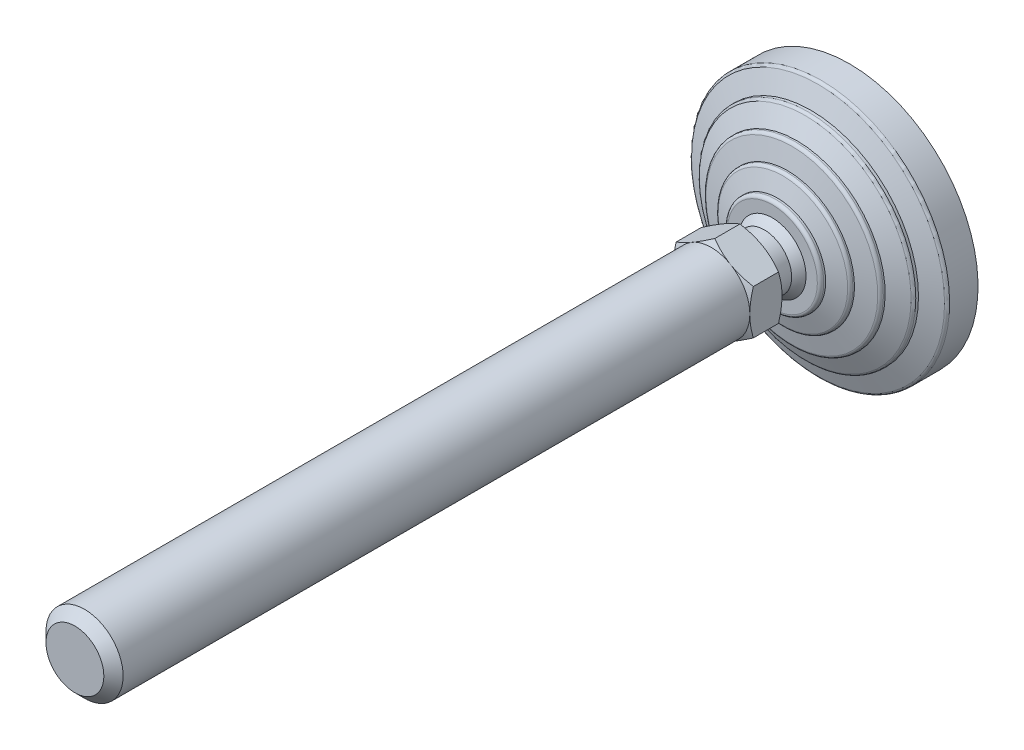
ISO-10303-21;
HEADER;
FILE_DESCRIPTION(('STEP AP214'),'2;1');
FILE_NAME('part.step','',(''),(''),'','','');
FILE_SCHEMA(('AUTOMOTIVE_DESIGN { 1 0 10303 214 1 1 1 1 }'));
ENDSEC;
DATA;
#1=APPLICATION_CONTEXT('core data for automotive mechanical design processes');
#2=APPLICATION_PROTOCOL_DEFINITION('international standard','automotive_design',2000,#1);
#3=PRODUCT_CONTEXT('',#1,'mechanical');
#4=PRODUCT('Part','Part','',(#3));
#5=PRODUCT_RELATED_PRODUCT_CATEGORY('part','',(#4));
#6=PRODUCT_DEFINITION_FORMATION('','',#4);
#7=PRODUCT_DEFINITION_CONTEXT('part definition',#1,'design');
#8=PRODUCT_DEFINITION('design','',#6,#7);
#9=PRODUCT_DEFINITION_SHAPE('','',#8);
#10=(LENGTH_UNIT() NAMED_UNIT(*) SI_UNIT(.MILLI.,.METRE.));
#11=(NAMED_UNIT(*) PLANE_ANGLE_UNIT() SI_UNIT($,.RADIAN.));
#12=(NAMED_UNIT(*) SI_UNIT($,.STERADIAN.) SOLID_ANGLE_UNIT());
#13=UNCERTAINTY_MEASURE_WITH_UNIT(LENGTH_MEASURE(1.E-05),#10,'distance_accuracy_value','');
#14=(GEOMETRIC_REPRESENTATION_CONTEXT(3) GLOBAL_UNCERTAINTY_ASSIGNED_CONTEXT((#13)) GLOBAL_UNIT_ASSIGNED_CONTEXT((#10,
#11,#12)) REPRESENTATION_CONTEXT('',''));
#15=CARTESIAN_POINT('',(0.,0.,0.));
#16=DIRECTION('',(0.,0.,1.));
#17=DIRECTION('',(1.,0.,0.));
#18=AXIS2_PLACEMENT_3D('',#15,#16,#17);
#19=CARTESIAN_POINT('',(-8.4999999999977,0.,32.9999999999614));
#20=DIRECTION('',(0.,0.,1.));
#21=DIRECTION('',(0.,-1.,0.));
#22=AXIS2_PLACEMENT_3D('',#19,#20,#21);
#23=PLANE('',#22);
#24=CARTESIAN_POINT('',(0.,0.,32.9999999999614));
#25=DIRECTION('',(0.,0.,-1.));
#26=DIRECTION('',(0.,1.,0.));
#27=AXIS2_PLACEMENT_3D('',#24,#25,#26);
#28=CIRCLE('',#27,8.4999999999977);
#29=CARTESIAN_POINT('',(0.,8.4999999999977,32.9999999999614));
#30=VERTEX_POINT('',#29);
#31=EDGE_CURVE('E337',#30,#30,#28,.T.);
#32=ORIENTED_EDGE('',*,*,#31,.F.);
#33=EDGE_LOOP('',(#32));
#34=FACE_BOUND('',#33,.T.);
#35=CARTESIAN_POINT('',(0.,0.,32.9999999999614));
#36=DIRECTION('',(0.,0.,-1.));
#37=DIRECTION('',(-1.,0.,0.));
#38=AXIS2_PLACEMENT_3D('',#35,#36,#37);
#39=CIRCLE('',#38,11.9999999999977);
#40=CARTESIAN_POINT('',(6.,10.3923048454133,32.9999999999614));
#41=VERTEX_POINT('',#40);
#42=CARTESIAN_POINT('',(12.,0.,32.9999999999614));
#43=VERTEX_POINT('',#42);
#44=EDGE_CURVE('E493',#41,#43,#39,.T.);
#45=ORIENTED_EDGE('',*,*,#44,.T.);
#46=CARTESIAN_POINT('',(6.,-10.3923048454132,32.9999999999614));
#47=VERTEX_POINT('',#46);
#48=EDGE_CURVE('E140',#43,#47,#39,.T.);
#49=ORIENTED_EDGE('',*,*,#48,.T.);
#50=CARTESIAN_POINT('',(-6.,-10.3923048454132,32.9999999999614));
#51=VERTEX_POINT('',#50);
#52=EDGE_CURVE('E139',#47,#51,#39,.T.);
#53=ORIENTED_EDGE('',*,*,#52,.T.);
#54=CARTESIAN_POINT('',(-12.,0.,32.9999999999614));
#55=VERTEX_POINT('',#54);
#56=EDGE_CURVE('E117',#51,#55,#39,.T.);
#57=ORIENTED_EDGE('',*,*,#56,.T.);
#58=CARTESIAN_POINT('',(-6.,10.3923048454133,32.9999999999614));
#59=VERTEX_POINT('',#58);
#60=EDGE_CURVE('E105',#55,#59,#39,.T.);
#61=ORIENTED_EDGE('',*,*,#60,.T.);
#62=EDGE_CURVE('E34',#59,#41,#39,.T.);
#63=ORIENTED_EDGE('',*,*,#62,.T.);
#64=EDGE_LOOP('',(#45,#49,#53,#57,#61,#63));
#65=FACE_BOUND('',#64,.T.);
#66=ADVANCED_FACE('F14',(#34,#65),#23,.F.);
#67=CARTESIAN_POINT('',(0.,0.,0.));
#68=DIRECTION('',(0.,0.,-1.));
#69=DIRECTION('',(0.,1.,0.));
#70=AXIS2_PLACEMENT_3D('',#67,#68,#69);
#71=CYLINDRICAL_SURFACE('',#70,8.4999999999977);
#72=CARTESIAN_POINT('',(0.,0.,26.4999999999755));
#73=DIRECTION('',(0.,0.,-1.));
#74=DIRECTION('',(0.,1.,0.));
#75=AXIS2_PLACEMENT_3D('',#72,#73,#74);
#76=CIRCLE('',#75,8.4999999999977);
#77=CARTESIAN_POINT('',(0.,8.4999999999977,26.4999999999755));
#78=VERTEX_POINT('',#77);
#79=EDGE_CURVE('E340',#78,#78,#76,.T.);
#80=ORIENTED_EDGE('',*,*,#79,.F.);
#81=EDGE_LOOP('',(#80));
#82=FACE_BOUND('',#81,.T.);
#83=ORIENTED_EDGE('',*,*,#31,.T.);
#84=EDGE_LOOP('',(#83));
#85=FACE_BOUND('',#84,.T.);
#86=ADVANCED_FACE('F305',(#82,#85),#71,.T.);
#87=CARTESIAN_POINT('',(-8.4999999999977,0.,26.4999999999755));
#88=DIRECTION('',(0.,0.,1.));
#89=DIRECTION('',(0.,-1.,0.));
#90=AXIS2_PLACEMENT_3D('',#87,#88,#89);
#91=PLANE('',#90);
#92=CARTESIAN_POINT('',(0.,0.,26.4999999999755));
#93=DIRECTION('',(0.,0.,-1.));
#94=DIRECTION('',(0.,1.,0.));
#95=AXIS2_PLACEMENT_3D('',#92,#93,#94);
#96=CIRCLE('',#95,8.49107182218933);
#97=CARTESIAN_POINT('',(-8.49107182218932,0.,26.4999999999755));
#98=VERTEX_POINT('',#97);
#99=EDGE_CURVE('E343',#98,#98,#96,.T.);
#100=ORIENTED_EDGE('',*,*,#99,.F.);
#101=EDGE_LOOP('',(#100));
#102=FACE_BOUND('',#101,.T.);
#103=ORIENTED_EDGE('',*,*,#79,.T.);
#104=EDGE_LOOP('',(#103));
#105=FACE_BOUND('',#104,.T.);
#106=ADVANCED_FACE('F301',(#102,#105),#91,.F.);
#107=CARTESIAN_POINT('',(-2.80331313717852E-12,0.,17.6702661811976));
#108=DIRECTION('',(0.,0.,-1.));
#109=DIRECTION('',(-1.,0.,0.));
#110=AXIS2_PLACEMENT_3D('',#107,#108,#109);
#111=SPHERICAL_SURFACE('',#110,12.25);
#112=CARTESIAN_POINT('',(0.,0.,24.));
#113=DIRECTION('',(0.,0.,-1.));
#114=DIRECTION('',(0.,1.,0.));
#115=AXIS2_PLACEMENT_3D('',#112,#113,#114);
#116=CIRCLE('',#115,10.4879440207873);
#117=CARTESIAN_POINT('',(-10.4879440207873,0.,24.));
#118=VERTEX_POINT('',#117);
#119=EDGE_CURVE('E346',#118,#118,#116,.T.);
#120=CARTESIAN_POINT('',(-10.4879440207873,0.,24.));
#121=CARTESIAN_POINT('',(-10.4706730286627,0.,24.0286168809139));
#122=CARTESIAN_POINT('',(-10.4532849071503,0.,24.0571630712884));
#123=CARTESIAN_POINT('',(-10.4182755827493,0.,24.1141121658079));
#124=CARTESIAN_POINT('',(-10.4006543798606,0.,24.1425150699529));
#125=CARTESIAN_POINT('',(-10.3651800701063,0.,24.1991756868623));
#126=CARTESIAN_POINT('',(-10.3473269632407,0.,24.2274333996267));
#127=CARTESIAN_POINT('',(-10.3113900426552,0.,24.283801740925));
#128=CARTESIAN_POINT('',(-10.2933062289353,0.,24.3119123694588));
#129=CARTESIAN_POINT('',(-10.2569091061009,0.,24.367984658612));
#130=CARTESIAN_POINT('',(-10.2385957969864,0.,24.3959463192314));
#131=CARTESIAN_POINT('',(-10.2017409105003,0.,24.4517187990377));
#132=CARTESIAN_POINT('',(-10.1831993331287,0.,24.4795296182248));
#133=CARTESIAN_POINT('',(-10.1458891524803,0.,24.5349985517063));
#134=CARTESIAN_POINT('',(-10.1271205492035,0.,24.5626566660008));
#135=CARTESIAN_POINT('',(-10.0893575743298,0.,24.6178183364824));
#136=CARTESIAN_POINT('',(-10.0703632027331,0.,24.6453218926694));
#137=CARTESIAN_POINT('',(-10.0321499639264,0.,24.7001726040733));
#138=CARTESIAN_POINT('',(-10.0129310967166,0.,24.7275197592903));
#139=CARTESIAN_POINT('',(-9.97427015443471,0.,24.7820558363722));
#140=CARTESIAN_POINT('',(-9.95482807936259,0.,24.8092447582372));
#141=CARTESIAN_POINT('',(-9.91572202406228,0.,24.8634625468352));
#142=CARTESIAN_POINT('',(-9.89605804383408,0.,24.8904914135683));
#143=CARTESIAN_POINT('',(-9.85650949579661,0.,24.9443872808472));
#144=CARTESIAN_POINT('',(-9.83662492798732,0.,24.9712542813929));
#145=CARTESIAN_POINT('',(-9.79663653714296,0.,25.0248246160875));
#146=CARTESIAN_POINT('',(-9.7765327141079,0.,25.0515279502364));
#147=CARTESIAN_POINT('',(-9.73610715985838,0.,25.1047691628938));
#148=CARTESIAN_POINT('',(-9.71578542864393,0.,25.1313070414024));
#149=CARTESIAN_POINT('',(-9.67492541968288,0.,25.1842155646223));
#150=CARTESIAN_POINT('',(-9.65438714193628,0.,25.2105862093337));
#151=CARTESIAN_POINT('',(-9.61309541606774,0.,25.2631584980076));
#152=CARTESIAN_POINT('',(-9.5923419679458,0.,25.2893601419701));
#153=CARTESIAN_POINT('',(-9.55062129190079,0.,25.3415926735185));
#154=CARTESIAN_POINT('',(-9.52965406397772,0.,25.3676235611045));
#155=CARTESIAN_POINT('',(-9.48750723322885,0.,25.4195128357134));
#156=CARTESIAN_POINT('',(-9.46632763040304,0.,25.4453712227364));
#157=CARTESIAN_POINT('',(-9.42375746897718,0.,25.4969137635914));
#158=CARTESIAN_POINT('',(-9.40236691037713,0.,25.5225979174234));
#159=CARTESIAN_POINT('',(-9.35937627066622,0.,25.5737902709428));
#160=CARTESIAN_POINT('',(-9.33777618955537,0.,25.5992984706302));
#161=CARTESIAN_POINT('',(-9.29436795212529,0.,25.6501372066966));
#162=CARTESIAN_POINT('',(-9.27255979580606,0.,25.6754677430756));
#163=CARTESIAN_POINT('',(-9.2287368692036,0.,25.7259494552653));
#164=CARTESIAN_POINT('',(-9.20672209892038,0.,25.7511006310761));
#165=CARTESIAN_POINT('',(-9.16248741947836,0.,25.8012219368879));
#166=CARTESIAN_POINT('',(-9.14026751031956,0.,25.8261920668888));
#167=CARTESIAN_POINT('',(-9.09562404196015,0.,25.8759496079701));
#168=CARTESIAN_POINT('',(-9.07320048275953,0.,25.9007370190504));
#169=CARTESIAN_POINT('',(-9.02815121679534,0.,25.9501274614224));
#170=CARTESIAN_POINT('',(-9.00552551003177,0.,25.974730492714));
#171=CARTESIAN_POINT('',(-8.96007346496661,0.,26.0237505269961));
#172=CARTESIAN_POINT('',(-8.93724712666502,0.,26.0481675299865));
#173=CARTESIAN_POINT('',(-8.89139534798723,0.,26.0968138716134));
#174=CARTESIAN_POINT('',(-8.86836990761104,0.,26.1210432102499));
#175=CARTESIAN_POINT('',(-8.82212146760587,0.,26.1693125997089));
#176=CARTESIAN_POINT('',(-8.7988984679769,0.,26.1933526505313));
#177=CARTESIAN_POINT('',(-8.75225646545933,0.,26.2412418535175));
#178=CARTESIAN_POINT('',(-8.72883746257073,0.,26.2650910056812));
#179=CARTESIAN_POINT('',(-8.68180502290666,0.,26.3125968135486));
#180=CARTESIAN_POINT('',(-8.6581915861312,0.,26.3362534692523));
#181=CARTESIAN_POINT('',(-8.61077186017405,0.,26.3833726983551));
#182=CARTESIAN_POINT('',(-8.58696557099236,0.,26.4068352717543));
#183=CARTESIAN_POINT('',(-8.53916173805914,0.,26.4535647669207));
#184=CARTESIAN_POINT('',(-8.5151641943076,0.,26.4768316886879));
#185=CARTESIAN_POINT('',(-8.49107182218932,0.,26.4999999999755));
#186=B_SPLINE_CURVE_WITH_KNOTS('',3,(#120,#121,#122,#123,#124,#125,#126,#127,#128,#129,#130,
#131,#132,#133,#134,#135,#136,#137,#138,#139,#140,#141,#142,#143,#144,#145,#146,#147,#148,#149,
#150,#151,#152,#153,#154,#155,#156,#157,#158,#159,#160,#161,#162,#163,#164,#165,#166,#167,#168,
#169,#170,#171,#172,#173,#174,#175,#176,#177,#178,#179,#180,#181,#182,#183,#184,#185),
.UNSPECIFIED.,.F.,.F.,(4,2,2,2,2,2,2,2,2,2,2,2,2,2,2,2,2,2,2,2,2,2,2,2,2,2,2,2,2,2,2,2,4),(0.,
0.100273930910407,0.200547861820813,0.300821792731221,0.401095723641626,0.501369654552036,
0.601643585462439,0.701917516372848,0.802191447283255,0.902465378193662,1.00273930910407,
1.10301324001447,1.20328717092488,1.30356110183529,1.4038350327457,1.5041089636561,
1.60438289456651,1.70465682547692,1.80493075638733,1.90520468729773,2.00547861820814,
2.10575254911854,2.20602648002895,2.30630041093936,2.40657434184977,2.50684827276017,
2.60712220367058,2.70739613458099,2.80767006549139,2.9079439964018,3.00821792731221,
3.10849185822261,3.20876578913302),.UNSPECIFIED.);
#187=EDGE_CURVE('BSEAM297',#118,#98,#186,.T.);
#188=ORIENTED_EDGE('',*,*,#119,.F.);
#189=ORIENTED_EDGE('',*,*,#99,.T.);
#190=ORIENTED_EDGE('',*,*,#187,.T.);
#191=ORIENTED_EDGE('',*,*,#187,.F.);
#192=EDGE_LOOP('',(#188,#190,#189,#191));
#193=FACE_BOUND('',#192,.T.);
#194=ADVANCED_FACE('F297',(#193),#111,.T.);
#195=CARTESIAN_POINT('',(-10.4879440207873,0.,24.));
#196=DIRECTION('',(0.,0.,-1.));
#197=DIRECTION('',(0.,1.,0.));
#198=AXIS2_PLACEMENT_3D('',#195,#196,#197);
#199=PLANE('',#198);
#200=CARTESIAN_POINT('',(0.,0.,24.));
#201=DIRECTION('',(0.,0.,-1.));
#202=DIRECTION('',(0.,1.,0.));
#203=AXIS2_PLACEMENT_3D('',#200,#201,#202);
#204=CIRCLE('',#203,13.9999999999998);
#205=CARTESIAN_POINT('',(0.,13.9999999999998,24.));
#206=VERTEX_POINT('',#205);
#207=EDGE_CURVE('E349',#206,#206,#204,.T.);
#208=ORIENTED_EDGE('',*,*,#207,.F.);
#209=EDGE_LOOP('',(#208));
#210=FACE_BOUND('',#209,.T.);
#211=ORIENTED_EDGE('',*,*,#119,.T.);
#212=EDGE_LOOP('',(#211));
#213=FACE_BOUND('',#212,.T.);
#214=ADVANCED_FACE('F293',(#210,#213),#199,.F.);
#215=CARTESIAN_POINT('',(0.,0.,23.));
#216=DIRECTION('',(0.,0.,-1.));
#217=DIRECTION('',(0.,1.,0.));
#218=AXIS2_PLACEMENT_3D('',#215,#216,#217);
#219=TOROIDAL_SURFACE('',#218,13.9999999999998,1.);
#220=CARTESIAN_POINT('',(0.,0.,23.));
#221=DIRECTION('',(0.,0.,-1.));
#222=DIRECTION('',(0.,1.,0.));
#223=AXIS2_PLACEMENT_3D('',#220,#221,#222);
#224=CIRCLE('',#223,14.9999999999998);
#225=CARTESIAN_POINT('',(0.,14.9999999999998,23.));
#226=VERTEX_POINT('',#225);
#227=EDGE_CURVE('E352',#226,#226,#224,.T.);
#228=ORIENTED_EDGE('',*,*,#227,.F.);
#229=EDGE_LOOP('',(#228));
#230=FACE_BOUND('',#229,.T.);
#231=ORIENTED_EDGE('',*,*,#207,.T.);
#232=EDGE_LOOP('',(#231));
#233=FACE_BOUND('',#232,.T.);
#234=ADVANCED_FACE('F289',(#230,#233),#219,.T.);
#235=CARTESIAN_POINT('',(0.,0.,0.));
#236=DIRECTION('',(0.,0.,-1.));
#237=DIRECTION('',(0.,1.,0.));
#238=AXIS2_PLACEMENT_3D('',#235,#236,#237);
#239=CYLINDRICAL_SURFACE('',#238,14.9999999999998);
#240=CARTESIAN_POINT('',(0.,0.,22.4025287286));
#241=DIRECTION('',(0.,0.,-1.));
#242=DIRECTION('',(0.,1.,0.));
#243=AXIS2_PLACEMENT_3D('',#240,#241,#242);
#244=CIRCLE('',#243,14.9999999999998);
#245=CARTESIAN_POINT('',(0.,14.9999999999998,22.4025287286));
#246=VERTEX_POINT('',#245);
#247=EDGE_CURVE('E355',#246,#246,#244,.T.);
#248=ORIENTED_EDGE('',*,*,#247,.F.);
#249=EDGE_LOOP('',(#248));
#250=FACE_BOUND('',#249,.T.);
#251=ORIENTED_EDGE('',*,*,#227,.T.);
#252=EDGE_LOOP('',(#251));
#253=FACE_BOUND('',#252,.T.);
#254=ADVANCED_FACE('F285',(#250,#253),#239,.T.);
#255=CARTESIAN_POINT('',(0.,0.,22.4025287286));
#256=DIRECTION('',(0.,0.,-1.));
#257=DIRECTION('',(0.,1.,0.));
#258=AXIS2_PLACEMENT_3D('',#255,#256,#257);
#259=CONICAL_SURFACE('',#258,14.9999999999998,1.25589726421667);
#260=CARTESIAN_POINT('',(0.,0.,20.7216684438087));
#261=DIRECTION('',(0.,0.,-1.));
#262=DIRECTION('',(0.,1.,0.));
#263=AXIS2_PLACEMENT_3D('',#260,#261,#262);
#264=CIRCLE('',#263,20.1601635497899);
#265=CARTESIAN_POINT('',(0.,20.1601635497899,20.7216684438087));
#266=VERTEX_POINT('',#265);
#267=EDGE_CURVE('E358',#266,#266,#264,.T.);
#268=ORIENTED_EDGE('',*,*,#267,.F.);
#269=EDGE_LOOP('',(#268));
#270=FACE_BOUND('',#269,.T.);
#271=ORIENTED_EDGE('',*,*,#247,.T.);
#272=EDGE_LOOP('',(#271));
#273=FACE_BOUND('',#272,.T.);
#274=ADVANCED_FACE('F281',(#270,#273),#259,.T.);
#275=CARTESIAN_POINT('',(0.,0.,19.7708407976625));
#276=DIRECTION('',(0.,0.,-1.));
#277=DIRECTION('',(0.,1.,0.));
#278=AXIS2_PLACEMENT_3D('',#275,#276,#277);
#279=TOROIDAL_SURFACE('',#278,19.8504430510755,1.);
#280=CARTESIAN_POINT('',(0.,0.,19.7708407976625));
#281=DIRECTION('',(0.,0.,-1.));
#282=DIRECTION('',(0.,1.,0.));
#283=AXIS2_PLACEMENT_3D('',#280,#281,#282);
#284=CIRCLE('',#283,20.8504430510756);
#285=CARTESIAN_POINT('',(0.,20.8504430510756,19.7708407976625));
#286=VERTEX_POINT('',#285);
#287=EDGE_CURVE('E361',#286,#286,#284,.T.);
#288=ORIENTED_EDGE('',*,*,#287,.F.);
#289=EDGE_LOOP('',(#288));
#290=FACE_BOUND('',#289,.T.);
#291=ORIENTED_EDGE('',*,*,#267,.T.);
#292=EDGE_LOOP('',(#291));
#293=FACE_BOUND('',#292,.T.);
#294=ADVANCED_FACE('F277',(#290,#293),#279,.T.);
#295=CARTESIAN_POINT('',(0.,0.,0.));
#296=DIRECTION('',(0.,0.,-1.));
#297=DIRECTION('',(0.,1.,0.));
#298=AXIS2_PLACEMENT_3D('',#295,#296,#297);
#299=CYLINDRICAL_SURFACE('',#298,20.8504430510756);
#300=CARTESIAN_POINT('',(0.,0.,19.2987385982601));
#301=DIRECTION('',(0.,0.,-1.));
#302=DIRECTION('',(0.,1.,0.));
#303=AXIS2_PLACEMENT_3D('',#300,#301,#302);
#304=CIRCLE('',#303,20.8504430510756);
#305=CARTESIAN_POINT('',(0.,20.8504430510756,19.2987385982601));
#306=VERTEX_POINT('',#305);
#307=EDGE_CURVE('E364',#306,#306,#304,.T.);
#308=ORIENTED_EDGE('',*,*,#307,.F.);
#309=EDGE_LOOP('',(#308));
#310=FACE_BOUND('',#309,.T.);
#311=ORIENTED_EDGE('',*,*,#287,.T.);
#312=EDGE_LOOP('',(#311));
#313=FACE_BOUND('',#312,.T.);
#314=ADVANCED_FACE('F273',(#310,#313),#299,.T.);
#315=CARTESIAN_POINT('',(0.,0.,19.2987385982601));
#316=DIRECTION('',(0.,0.,-1.));
#317=DIRECTION('',(0.,1.,0.));
#318=AXIS2_PLACEMENT_3D('',#315,#316,#317);
#319=CONICAL_SURFACE('',#318,20.8504430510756,1.34067144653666);
#320=CARTESIAN_POINT('',(0.,0.,17.9217501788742));
#321=DIRECTION('',(0.,0.,-1.));
#322=DIRECTION('',(0.,1.,0.));
#323=AXIS2_PLACEMENT_3D('',#320,#321,#322);
#324=CIRCLE('',#323,26.7280991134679);
#325=CARTESIAN_POINT('',(0.,26.7280991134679,17.9217501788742));
#326=VERTEX_POINT('',#325);
#327=EDGE_CURVE('E367',#326,#326,#324,.T.);
#328=ORIENTED_EDGE('',*,*,#327,.F.);
#329=EDGE_LOOP('',(#328));
#330=FACE_BOUND('',#329,.T.);
#331=ORIENTED_EDGE('',*,*,#307,.T.);
#332=EDGE_LOOP('',(#331));
#333=FACE_BOUND('',#332,.T.);
#334=ADVANCED_FACE('F269',(#330,#333),#319,.T.);
#335=CARTESIAN_POINT('',(0.,0.,16.9481122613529));
#336=DIRECTION('',(0.,0.,-1.));
#337=DIRECTION('',(0.,1.,0.));
#338=AXIS2_PLACEMENT_3D('',#335,#336,#337);
#339=TOROIDAL_SURFACE('',#338,26.5,1.);
#340=CARTESIAN_POINT('',(0.,0.,16.9481122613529));
#341=DIRECTION('',(0.,0.,-1.));
#342=DIRECTION('',(0.,1.,0.));
#343=AXIS2_PLACEMENT_3D('',#340,#341,#342);
#344=CIRCLE('',#343,27.5);
#345=CARTESIAN_POINT('',(0.,27.5,16.9481122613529));
#346=VERTEX_POINT('',#345);
#347=EDGE_CURVE('E370',#346,#346,#344,.T.);
#348=ORIENTED_EDGE('',*,*,#347,.F.);
#349=EDGE_LOOP('',(#348));
#350=FACE_BOUND('',#349,.T.);
#351=ORIENTED_EDGE('',*,*,#327,.T.);
#352=EDGE_LOOP('',(#351));
#353=FACE_BOUND('',#352,.T.);
#354=ADVANCED_FACE('F265',(#350,#353),#339,.T.);
#355=CARTESIAN_POINT('',(0.,0.,0.));
#356=DIRECTION('',(0.,0.,-1.));
#357=DIRECTION('',(0.,1.,0.));
#358=AXIS2_PLACEMENT_3D('',#355,#356,#357);
#359=CYLINDRICAL_SURFACE('',#358,27.5);
#360=CARTESIAN_POINT('',(0.,0.,16.4025287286));
#361=DIRECTION('',(0.,0.,-1.));
#362=DIRECTION('',(0.,1.,0.));
#363=AXIS2_PLACEMENT_3D('',#360,#361,#362);
#364=CIRCLE('',#363,27.5);
#365=CARTESIAN_POINT('',(0.,27.5,16.4025287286));
#366=VERTEX_POINT('',#365);
#367=EDGE_CURVE('E373',#366,#366,#364,.T.);
#368=ORIENTED_EDGE('',*,*,#367,.F.);
#369=EDGE_LOOP('',(#368));
#370=FACE_BOUND('',#369,.T.);
#371=ORIENTED_EDGE('',*,*,#347,.T.);
#372=EDGE_LOOP('',(#371));
#373=FACE_BOUND('',#372,.T.);
#374=ADVANCED_FACE('F261',(#370,#373),#359,.T.);
#375=CARTESIAN_POINT('',(0.,0.,16.4025287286));
#376=DIRECTION('',(0.,0.,-1.));
#377=DIRECTION('',(0.,1.,0.));
#378=AXIS2_PLACEMENT_3D('',#375,#376,#377);
#379=CONICAL_SURFACE('',#378,27.5,1.12022914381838);
#380=CARTESIAN_POINT('',(0.,0.,13.773091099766));
#381=DIRECTION('',(0.,0.,-1.));
#382=DIRECTION('',(0.,1.,0.));
#383=AXIS2_PLACEMENT_3D('',#380,#381,#382);
#384=CIRCLE('',#383,32.935476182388);
#385=CARTESIAN_POINT('',(0.,32.935476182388,13.773091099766));
#386=VERTEX_POINT('',#385);
#387=EDGE_CURVE('E376',#386,#386,#384,.T.);
#388=ORIENTED_EDGE('',*,*,#387,.F.);
#389=EDGE_LOOP('',(#388));
#390=FACE_BOUND('',#389,.T.);
#391=ORIENTED_EDGE('',*,*,#367,.T.);
#392=EDGE_LOOP('',(#391));
#393=FACE_BOUND('',#392,.T.);
#394=ADVANCED_FACE('F257',(#390,#393),#379,.T.);
#395=CARTESIAN_POINT('',(0.,0.,12.8728908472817));
#396=DIRECTION('',(0.,0.,-1.));
#397=DIRECTION('',(0.,1.,0.));
#398=AXIS2_PLACEMENT_3D('',#395,#396,#397);
#399=TOROIDAL_SURFACE('',#398,32.5,1.);
#400=CARTESIAN_POINT('',(0.,0.,12.8728908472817));
#401=DIRECTION('',(0.,0.,-1.));
#402=DIRECTION('',(0.,1.,0.));
#403=AXIS2_PLACEMENT_3D('',#400,#401,#402);
#404=CIRCLE('',#403,33.5);
#405=CARTESIAN_POINT('',(0.,33.5,12.8728908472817));
#406=VERTEX_POINT('',#405);
#407=EDGE_CURVE('E379',#406,#406,#404,.T.);
#408=ORIENTED_EDGE('',*,*,#407,.F.);
#409=EDGE_LOOP('',(#408));
#410=FACE_BOUND('',#409,.T.);
#411=ORIENTED_EDGE('',*,*,#387,.T.);
#412=EDGE_LOOP('',(#411));
#413=FACE_BOUND('',#412,.T.);
#414=ADVANCED_FACE('F253',(#410,#413),#399,.T.);
#415=CARTESIAN_POINT('',(0.,0.,0.));
#416=DIRECTION('',(0.,0.,-1.));
#417=DIRECTION('',(0.,1.,0.));
#418=AXIS2_PLACEMENT_3D('',#415,#416,#417);
#419=CYLINDRICAL_SURFACE('',#418,33.5);
#420=CARTESIAN_POINT('',(0.,0.,12.0315037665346));
#421=DIRECTION('',(0.,0.,-1.));
#422=DIRECTION('',(0.,1.,0.));
#423=AXIS2_PLACEMENT_3D('',#420,#421,#422);
#424=CIRCLE('',#423,33.5);
#425=CARTESIAN_POINT('',(0.,33.5,12.0315037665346));
#426=VERTEX_POINT('',#425);
#427=EDGE_CURVE('E382',#426,#426,#424,.T.);
#428=ORIENTED_EDGE('',*,*,#427,.F.);
#429=EDGE_LOOP('',(#428));
#430=FACE_BOUND('',#429,.T.);
#431=ORIENTED_EDGE('',*,*,#407,.T.);
#432=EDGE_LOOP('',(#431));
#433=FACE_BOUND('',#432,.T.);
#434=ADVANCED_FACE('F249',(#430,#433),#419,.T.);
#435=CARTESIAN_POINT('',(0.,0.,12.0315037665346));
#436=DIRECTION('',(0.,0.,-1.));
#437=DIRECTION('',(0.,1.,0.));
#438=AXIS2_PLACEMENT_3D('',#435,#436,#437);
#439=CONICAL_SURFACE('',#438,33.5,1.20362249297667);
#440=CARTESIAN_POINT('',(0.,0.,9.77805027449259));
#441=DIRECTION('',(0.,0.,-1.));
#442=DIRECTION('',(0.,1.,0.));
#443=AXIS2_PLACEMENT_3D('',#440,#441,#442);
#444=CIRCLE('',#443,39.3589790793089);
#445=CARTESIAN_POINT('',(0.,39.3589790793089,9.77805027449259));
#446=VERTEX_POINT('',#445);
#447=EDGE_CURVE('E385',#446,#446,#444,.T.);
#448=ORIENTED_EDGE('',*,*,#447,.F.);
#449=EDGE_LOOP('',(#448));
#450=FACE_BOUND('',#449,.T.);
#451=ORIENTED_EDGE('',*,*,#427,.T.);
#452=EDGE_LOOP('',(#451));
#453=FACE_BOUND('',#452,.T.);
#454=ADVANCED_FACE('F245',(#450,#453),#439,.T.);
#455=CARTESIAN_POINT('',(0.,0.,8.84470466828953));
#456=DIRECTION('',(0.,0.,-1.));
#457=DIRECTION('',(0.,1.,0.));
#458=AXIS2_PLACEMENT_3D('',#455,#456,#457);
#459=TOROIDAL_SURFACE('',#458,39.,1.);
#460=CARTESIAN_POINT('',(0.,0.,8.84470466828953));
#461=DIRECTION('',(0.,0.,-1.));
#462=DIRECTION('',(0.,1.,0.));
#463=AXIS2_PLACEMENT_3D('',#460,#461,#462);
#464=CIRCLE('',#463,40.);
#465=CARTESIAN_POINT('',(0.,40.,8.84470466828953));
#466=VERTEX_POINT('',#465);
#467=EDGE_CURVE('E388',#466,#466,#464,.T.);
#468=ORIENTED_EDGE('',*,*,#467,.F.);
#469=EDGE_LOOP('',(#468));
#470=FACE_BOUND('',#469,.T.);
#471=ORIENTED_EDGE('',*,*,#447,.T.);
#472=EDGE_LOOP('',(#471));
#473=FACE_BOUND('',#472,.T.);
#474=ADVANCED_FACE('F241',(#470,#473),#459,.T.);
#475=CARTESIAN_POINT('',(0.,0.,0.));
#476=DIRECTION('',(0.,0.,-1.));
#477=DIRECTION('',(0.,1.,0.));
#478=AXIS2_PLACEMENT_3D('',#475,#476,#477);
#479=CYLINDRICAL_SURFACE('',#478,40.);
#480=CARTESIAN_POINT('',(0.,0.,0.));
#481=DIRECTION('',(0.,0.,-1.));
#482=DIRECTION('',(0.,1.,0.));
#483=AXIS2_PLACEMENT_3D('',#480,#481,#482);
#484=CIRCLE('',#483,40.);
#485=CARTESIAN_POINT('',(0.,40.,0.));
#486=VERTEX_POINT('',#485);
#487=EDGE_CURVE('E391',#486,#486,#484,.T.);
#488=ORIENTED_EDGE('',*,*,#487,.F.);
#489=EDGE_LOOP('',(#488));
#490=FACE_BOUND('',#489,.T.);
#491=ORIENTED_EDGE('',*,*,#467,.T.);
#492=EDGE_LOOP('',(#491));
#493=FACE_BOUND('',#492,.T.);
#494=ADVANCED_FACE('F237',(#490,#493),#479,.T.);
#495=CARTESIAN_POINT('',(0.,0.,0.));
#496=DIRECTION('',(0.,0.,1.));
#497=DIRECTION('',(0.,-1.,0.));
#498=AXIS2_PLACEMENT_3D('',#495,#496,#497);
#499=PLANE('',#498);
#500=ORIENTED_EDGE('',*,*,#487,.T.);
#501=EDGE_LOOP('',(#500));
#502=FACE_BOUND('',#501,.T.);
#503=ADVANCED_FACE('F233',(#502),#499,.F.);
#504=CARTESIAN_POINT('',(0.,0.,35.7514584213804));
#505=DIRECTION('',(0.,0.,1.));
#506=DIRECTION('',(1.,0.,0.));
#507=AXIS2_PLACEMENT_3D('',#504,#505,#506);
#508=CONICAL_SURFACE('',#507,16.7656657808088,1.0471975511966);
#509=CARTESIAN_POINT('',(12.,-18.6086131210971,38.8556470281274));
#510=CARTESIAN_POINT('',(12.,-18.3465742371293,38.7285052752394));
#511=CARTESIAN_POINT('',(12.,-18.0842278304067,38.6019976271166));
#512=CARTESIAN_POINT('',(12.,-17.5588557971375,38.3503941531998));
#513=CARTESIAN_POINT('',(12.,-17.2958301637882,38.2252983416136));
#514=CARTESIAN_POINT('',(12.,-16.5055681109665,37.8523111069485));
#515=CARTESIAN_POINT('',(12.,-15.9772240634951,37.6067576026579));
#516=CARTESIAN_POINT('',(12.,-14.9141239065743,37.1220477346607));
#517=CARTESIAN_POINT('',(12.,-14.3793485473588,36.8829334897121));
#518=CARTESIAN_POINT('',(12.,-13.3055446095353,36.4144879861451));
#519=CARTESIAN_POINT('',(12.,-12.7665162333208,36.1851562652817));
#520=CARTESIAN_POINT('',(12.,-11.6659328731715,35.7316886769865));
#521=CARTESIAN_POINT('',(12.,-11.1042106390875,35.5079566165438));
#522=CARTESIAN_POINT('',(12.,-9.97418982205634,35.0774279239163));
#523=CARTESIAN_POINT('',(12.,-9.40589050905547,34.8706331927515));
#524=CARTESIAN_POINT('',(12.,-8.26289420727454,34.4794121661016));
#525=CARTESIAN_POINT('',(12.,-7.68821284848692,34.2949405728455));
#526=CARTESIAN_POINT('',(12.,-6.53055193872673,33.9542759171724));
#527=CARTESIAN_POINT('',(12.,-5.94757506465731,33.7980739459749));
#528=CARTESIAN_POINT('',(12.,-5.06840438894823,33.5910546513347));
#529=CARTESIAN_POINT('',(12.,-4.7753708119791,33.5267344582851));
#530=CARTESIAN_POINT('',(12.,-4.18730163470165,33.4079543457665));
#531=CARTESIAN_POINT('',(12.,-3.89226607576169,33.3534942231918));
#532=CARTESIAN_POINT('',(12.,-3.30039617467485,33.2553956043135));
#533=CARTESIAN_POINT('',(12.,-3.00356185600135,33.2117569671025));
#534=CARTESIAN_POINT('',(12.,-2.40840945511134,33.1361719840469));
#535=CARTESIAN_POINT('',(12.,-2.11009143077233,33.1042251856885));
#536=CARTESIAN_POINT('',(12.,-1.5162823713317,33.0530589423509));
#537=CARTESIAN_POINT('',(12.,-1.22080526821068,33.0336787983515));
#538=CARTESIAN_POINT('',(12.,-0.62929689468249,33.0074310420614));
#539=CARTESIAN_POINT('',(12.,-0.333265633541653,33.0005632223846));
#540=CARTESIAN_POINT('',(12.,0.25882266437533,32.9995034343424));
#541=CARTESIAN_POINT('',(12.,0.554879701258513,33.0053115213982));
#542=CARTESIAN_POINT('',(12.,1.14648558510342,33.0294619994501));
#543=CARTESIAN_POINT('',(12.,1.44203440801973,33.047804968));
#544=CARTESIAN_POINT('',(12.,2.1523830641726,33.1065674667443));
#545=CARTESIAN_POINT('',(12.,2.56669931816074,33.1529372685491));
#546=CARTESIAN_POINT('',(12.,3.39225836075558,33.26778456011));
#547=CARTESIAN_POINT('',(12.,3.80350072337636,33.3362650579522));
#548=CARTESIAN_POINT('',(12.,4.62251989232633,33.4928976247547));
#549=CARTESIAN_POINT('',(12.,5.03029373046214,33.5810650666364));
#550=CARTESIAN_POINT('',(12.,5.84175147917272,33.7743809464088));
#551=CARTESIAN_POINT('',(12.,6.2454354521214,33.8795291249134));
#552=CARTESIAN_POINT('',(12.,7.05756517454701,34.1067258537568));
#553=CARTESIAN_POINT('',(12.,7.46592060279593,34.229095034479));
#554=CARTESIAN_POINT('',(12.,8.27860879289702,34.4864648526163));
#555=CARTESIAN_POINT('',(12.,8.68294152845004,34.6214655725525));
#556=CARTESIAN_POINT('',(12.,9.48778412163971,34.9019560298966));
#557=CARTESIAN_POINT('',(12.,9.88829520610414,35.0474422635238));
#558=CARTESIAN_POINT('',(12.,10.6859997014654,35.3471933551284));
#559=CARTESIAN_POINT('',(12.,11.0831931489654,35.501458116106));
#560=CARTESIAN_POINT('',(12.,12.0111105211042,35.8717743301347));
#561=CARTESIAN_POINT('',(12.,12.5406502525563,36.0907883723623));
#562=CARTESIAN_POINT('',(12.,13.5952913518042,36.5392839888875));
#563=CARTESIAN_POINT('',(12.,14.1203924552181,36.7687661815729));
#564=CARTESIAN_POINT('',(12.,15.1669694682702,37.2361293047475));
#565=CARTESIAN_POINT('',(12.,15.6884445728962,37.4740120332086));
#566=CARTESIAN_POINT('',(12.,16.7282530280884,37.9565040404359));
#567=CARTESIAN_POINT('',(12.,17.2465864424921,38.2011131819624));
#568=CARTESIAN_POINT('',(12.,18.2811762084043,38.6960788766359));
#569=CARTESIAN_POINT('',(12.,18.7974297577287,38.9464412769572));
#570=CARTESIAN_POINT('',(12.,19.8277184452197,39.4516888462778));
#571=CARTESIAN_POINT('',(12.,20.3417535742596,39.7065740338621));
#572=CARTESIAN_POINT('',(12.,21.3678785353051,40.2200683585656));
#573=CARTESIAN_POINT('',(12.,21.8799686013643,40.4786770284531));
#574=CARTESIAN_POINT('',(12.,22.9025454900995,40.9990466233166));
#575=CARTESIAN_POINT('',(12.,23.4130323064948,41.2608075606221));
#576=CARTESIAN_POINT('',(12.,24.8583632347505,42.0066817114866));
#577=CARTESIAN_POINT('',(12.,25.7915867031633,42.4939353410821));
#578=CARTESIAN_POINT('',(12.,27.6545411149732,43.4751346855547));
#579=CARTESIAN_POINT('',(12.,28.5842719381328,43.9690806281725));
#580=CARTESIAN_POINT('',(12.,30.4387232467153,44.9608960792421));
#581=CARTESIAN_POINT('',(12.,31.3634504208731,45.4587530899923));
#582=CARTESIAN_POINT('',(12.,32.7488887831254,46.2085290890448));
#583=CARTESIAN_POINT('',(12.,33.2104139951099,46.458946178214));
#584=CARTESIAN_POINT('',(12.,34.132975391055,46.9606779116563));
#585=CARTESIAN_POINT('',(12.,34.5940115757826,47.2119925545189));
#586=CARTESIAN_POINT('',(12.,35.0548307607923,47.4637045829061));
#587=B_SPLINE_CURVE_WITH_KNOTS('',3,(#509,#510,#511,#512,#513,#514,#515,#516,#517,#518,#519,
#520,#521,#522,#523,#524,#525,#526,#527,#528,#529,#530,#531,#532,#533,#534,#535,#536,#537,#538,
#539,#540,#541,#542,#543,#544,#545,#546,#547,#548,#549,#550,#551,#552,#553,#554,#555,#556,#557,
#558,#559,#560,#561,#562,#563,#564,#565,#566,#567,#568,#569,#570,#571,#572,#573,#574,#575,#576,
#577,#578,#579,#580,#581,#582,#583,#584,#585,#586),.UNSPECIFIED.,.F.,.F.,(4,2,2,2,2,2,2,2,2,2,2,
2,2,2,2,2,2,2,2,2,2,2,2,2,2,2,2,2,2,2,2,2,2,2,2,2,2,2,4),(0.,0.873763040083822,1.74753486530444,
3.49533714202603,5.25265738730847,7.00989450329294,8.82360192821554,10.6375126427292,
12.4476785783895,14.2572730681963,15.1571628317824,16.0570340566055,16.9568935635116,
17.8567182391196,18.7447965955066,19.6328602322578,20.5209277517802,21.4090361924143,
22.6590534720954,23.909240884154,25.1604079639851,26.4115559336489,27.6902000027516,
28.9688524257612,30.2470795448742,31.5252925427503,33.2442729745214,34.9633550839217,
36.6828073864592,38.4022246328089,40.1234742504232,41.8447309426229,43.5657734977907,
45.2868227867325,48.4450881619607,51.6034612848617,54.7541362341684,56.3293904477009,
57.9046421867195),.UNSPECIFIED.);
#588=CARTESIAN_POINT('',(12.,6.92820323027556,34.0717967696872));
#589=VERTEX_POINT('',#588);
#590=EDGE_CURVE('E115',#589,#43,#587,.F.);
#591=ORIENTED_EDGE('',*,*,#590,.T.);
#592=ORIENTED_EDGE('',*,*,#44,.F.);
#593=CARTESIAN_POINT('',(-0.00019999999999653,13.8565219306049,34.0718634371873));
#594=CARTESIAN_POINT('',(0.263585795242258,13.7042251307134,33.9839496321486));
#595=CARTESIAN_POINT('',(0.528355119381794,13.5513604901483,33.9000259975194));
#596=CARTESIAN_POINT('',(1.06001701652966,13.2444053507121,33.7412662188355));
#597=CARTESIAN_POINT('',(1.32691025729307,13.0903144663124,33.6664330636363));
#598=CARTESIAN_POINT('',(2.13189040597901,12.6255589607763,33.4570175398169));
#599=CARTESIAN_POINT('',(2.6731550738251,12.3130596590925,33.3379032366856));
#600=CARTESIAN_POINT('',(3.483132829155,11.8454187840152,33.1982310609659));
#601=CARTESIAN_POINT('',(3.74942610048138,11.6916742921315,33.1584437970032));
#602=CARTESIAN_POINT('',(4.28324559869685,11.3834734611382,33.0917233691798));
#603=CARTESIAN_POINT('',(4.55077184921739,11.2290171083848,33.0647904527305));
#604=CARTESIAN_POINT('',(5.08627036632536,10.9198468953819,33.0244685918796));
#605=CARTESIAN_POINT('',(5.35424172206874,10.7651335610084,33.011063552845));
#606=CARTESIAN_POINT('',(5.89043273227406,10.4555635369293,32.9980830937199));
#607=CARTESIAN_POINT('',(6.15865237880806,10.3007068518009,32.9985072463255));
#608=CARTESIAN_POINT('',(6.66008937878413,10.0112020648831,33.0122200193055));
#609=CARTESIAN_POINT('',(6.89334249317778,9.87653331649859,33.0238359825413));
#610=CARTESIAN_POINT('',(7.35931224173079,9.60750555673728,33.0573080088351));
#611=CARTESIAN_POINT('',(7.5920288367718,9.47314656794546,33.0791647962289));
#612=CARTESIAN_POINT('',(8.05679907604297,9.20481134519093,33.1327374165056));
#613=CARTESIAN_POINT('',(8.28885201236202,9.07083551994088,33.1644613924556));
#614=CARTESIAN_POINT('',(8.751869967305,8.80351197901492,33.2372117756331));
#615=CARTESIAN_POINT('',(8.98283491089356,8.6701643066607,33.2782388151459));
#616=CARTESIAN_POINT('',(9.68394195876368,8.26537996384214,33.4163116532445));
#617=CARTESIAN_POINT('',(10.1520537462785,7.9951154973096,33.527124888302));
#618=CARTESIAN_POINT('',(11.0812971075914,7.45861659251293,33.7786257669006));
#619=CARTESIAN_POINT('',(11.5424405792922,7.19237528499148,33.9192543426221));
#620=CARTESIAN_POINT('',(12.0002,6.92808776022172,34.0718634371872));
#621=B_SPLINE_CURVE_WITH_KNOTS('',3,(#593,#594,#595,#596,#597,#598,#599,#600,#601,#602,#603,
#604,#605,#606,#607,#608,#609,#610,#611,#612,#613,#614,#615,#616,#617,#618,#619,#620),
.UNSPECIFIED.,.F.,.F.,(4,2,2,2,2,2,2,2,2,2,2,2,2,4),(0.,0.951004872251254,1.90232158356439,
3.8090046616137,4.73894551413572,5.66890426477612,6.59775529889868,7.52657763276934,
8.33514643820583,9.14377244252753,9.95306755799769,10.7624176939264,12.4167102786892,
14.0677556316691),.UNSPECIFIED.);
#622=EDGE_CURVE('E18',#41,#589,#621,.T.);
#623=ORIENTED_EDGE('',*,*,#622,.T.);
#624=EDGE_LOOP('',(#591,#592,#623));
#625=FACE_BOUND('',#624,.T.);
#626=ADVANCED_FACE('F157',(#625),#508,.T.);
#627=CARTESIAN_POINT('',(-12.0002,6.92808776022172,34.0718634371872));
#628=CARTESIAN_POINT('',(-11.7364142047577,7.08038456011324,33.9839496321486));
#629=CARTESIAN_POINT('',(-11.4716448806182,7.23324920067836,33.9000259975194));
#630=CARTESIAN_POINT('',(-10.9399829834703,7.54020434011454,33.7412662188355));
#631=CARTESIAN_POINT('',(-10.6730897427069,7.69429522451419,33.6664330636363));
#632=CARTESIAN_POINT('',(-9.86810959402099,8.15905073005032,33.4570175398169));
#633=CARTESIAN_POINT('',(-9.3268449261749,8.4715500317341,33.3379032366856));
#634=CARTESIAN_POINT('',(-8.516867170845,8.93919090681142,33.1982310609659));
#635=CARTESIAN_POINT('',(-8.25057389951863,9.09293539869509,33.1584437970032));
#636=CARTESIAN_POINT('',(-7.71675440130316,9.40113622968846,33.0917233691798));
#637=CARTESIAN_POINT('',(-7.44922815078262,9.55559258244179,33.0647904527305));
#638=CARTESIAN_POINT('',(-6.91372963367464,9.86476279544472,33.0244685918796));
#639=CARTESIAN_POINT('',(-6.64575827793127,10.0194761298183,33.011063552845));
#640=CARTESIAN_POINT('',(-6.10956726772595,10.3290461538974,32.9980830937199));
#641=CARTESIAN_POINT('',(-5.84134762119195,10.4839028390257,32.9985072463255));
#642=CARTESIAN_POINT('',(-5.33991062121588,10.7734076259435,33.0122200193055));
#643=CARTESIAN_POINT('',(-5.10665750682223,10.908076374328,33.0238359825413));
#644=CARTESIAN_POINT('',(-4.64068775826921,11.1771041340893,33.0573080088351));
#645=CARTESIAN_POINT('',(-4.40797116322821,11.3114631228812,33.0791647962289));
#646=CARTESIAN_POINT('',(-3.94320092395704,11.5797983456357,33.1327374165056));
#647=CARTESIAN_POINT('',(-3.71114798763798,11.7137741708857,33.1644613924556));
#648=CARTESIAN_POINT('',(-3.24813003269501,11.9810977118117,33.2372117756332));
#649=CARTESIAN_POINT('',(-3.01716508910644,12.1144453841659,33.2782388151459));
#650=CARTESIAN_POINT('',(-2.31605804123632,12.5192297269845,33.4163116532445));
#651=CARTESIAN_POINT('',(-1.84794625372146,12.789494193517,33.527124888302));
#652=CARTESIAN_POINT('',(-0.91870289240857,13.3259930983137,33.7786257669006));
#653=CARTESIAN_POINT('',(-0.457559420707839,13.5922344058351,33.9192543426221));
#654=CARTESIAN_POINT('',(0.000200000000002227,13.8565219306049,34.0718634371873));
#655=B_SPLINE_CURVE_WITH_KNOTS('',3,(#627,#628,#629,#630,#631,#632,#633,#634,#635,#636,#637,
#638,#639,#640,#641,#642,#643,#644,#645,#646,#647,#648,#649,#650,#651,#652,#653,#654),
.UNSPECIFIED.,.F.,.F.,(4,2,2,2,2,2,2,2,2,2,2,2,2,4),(0.,0.95100487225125,1.90232158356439,
3.80900466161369,4.73894551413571,5.6689042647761,6.59775529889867,7.52657763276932,
8.33514643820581,9.14377244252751,9.95306755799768,10.7624176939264,12.4167102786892,
14.0677556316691),.UNSPECIFIED.);
#656=CARTESIAN_POINT('',(0.,13.8564064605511,34.0717967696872));
#657=VERTEX_POINT('',#656);
#658=EDGE_CURVE('E149',#59,#657,#655,.T.);
#659=ORIENTED_EDGE('',*,*,#658,.T.);
#660=EDGE_CURVE('E9',#657,#41,#621,.T.);
#661=ORIENTED_EDGE('',*,*,#660,.T.);
#662=ORIENTED_EDGE('',*,*,#62,.F.);
#663=EDGE_LOOP('',(#659,#661,#662));
#664=FACE_BOUND('',#663,.T.);
#665=ADVANCED_FACE('F486',(#664),#508,.T.);
#666=CARTESIAN_POINT('',(12.0002,-6.92808776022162,34.0718634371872));
#667=CARTESIAN_POINT('',(11.7364142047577,-7.08038456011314,33.9839496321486));
#668=CARTESIAN_POINT('',(11.4716448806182,-7.23324920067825,33.9000259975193));
#669=CARTESIAN_POINT('',(10.9399829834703,-7.54020434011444,33.7412662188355));
#670=CARTESIAN_POINT('',(10.6730897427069,-7.69429522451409,33.6664330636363));
#671=CARTESIAN_POINT('',(9.868109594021,-8.15905073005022,33.4570175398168));
#672=CARTESIAN_POINT('',(9.32684492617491,-8.47155003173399,33.3379032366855));
#673=CARTESIAN_POINT('',(8.51686717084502,-8.93919090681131,33.1982310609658));
#674=CARTESIAN_POINT('',(8.25057389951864,-9.09293539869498,33.1584437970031));
#675=CARTESIAN_POINT('',(7.71675440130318,-9.40113622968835,33.0917233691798));
#676=CARTESIAN_POINT('',(7.44922815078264,-9.55559258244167,33.0647904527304));
#677=CARTESIAN_POINT('',(6.91372963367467,-9.86476279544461,33.0244685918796));
#678=CARTESIAN_POINT('',(6.64575827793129,-10.0194761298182,33.011063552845));
#679=CARTESIAN_POINT('',(6.10956726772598,-10.3290461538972,32.9980830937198));
#680=CARTESIAN_POINT('',(5.84134762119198,-10.4839028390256,32.9985072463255));
#681=CARTESIAN_POINT('',(5.33991062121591,-10.7734076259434,33.0122200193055));
#682=CARTESIAN_POINT('',(5.10665750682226,-10.9080763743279,33.0238359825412));
#683=CARTESIAN_POINT('',(4.64068775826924,-11.1771041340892,33.057308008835));
#684=CARTESIAN_POINT('',(4.40797116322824,-11.311463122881,33.0791647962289));
#685=CARTESIAN_POINT('',(3.94320092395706,-11.5797983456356,33.1327374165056));
#686=CARTESIAN_POINT('',(3.711147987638,-11.7137741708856,33.1644613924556));
#687=CARTESIAN_POINT('',(3.24813003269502,-11.9810977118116,33.2372117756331));
#688=CARTESIAN_POINT('',(3.01716508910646,-12.1144453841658,33.2782388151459));
#689=CARTESIAN_POINT('',(2.31605804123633,-12.5192297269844,33.4163116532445));
#690=CARTESIAN_POINT('',(1.84794625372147,-12.7894941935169,33.527124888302));
#691=CARTESIAN_POINT('',(0.918702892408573,-13.3259930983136,33.7786257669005));
#692=CARTESIAN_POINT('',(0.45755942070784,-13.592234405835,33.9192543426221));
#693=CARTESIAN_POINT('',(-0.000200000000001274,-13.8565219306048,34.0718634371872));
#694=B_SPLINE_CURVE_WITH_KNOTS('',3,(#666,#667,#668,#669,#670,#671,#672,#673,#674,#675,#676,
#677,#678,#679,#680,#681,#682,#683,#684,#685,#686,#687,#688,#689,#690,#691,#692,#693),
.UNSPECIFIED.,.F.,.F.,(4,2,2,2,2,2,2,2,2,2,2,2,2,4),(0.,0.95100487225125,1.90232158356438,
3.80900466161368,4.7389455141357,5.66890426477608,6.59775529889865,7.5265776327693,
8.33514643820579,9.1437724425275,9.95306755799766,10.7624176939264,12.4167102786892,
14.0677556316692),.UNSPECIFIED.);
#695=CARTESIAN_POINT('',(12.,-6.92820323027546,34.0717967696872));
#696=VERTEX_POINT('',#695);
#697=EDGE_CURVE('E135',#696,#47,#694,.T.);
#698=ORIENTED_EDGE('',*,*,#697,.T.);
#699=ORIENTED_EDGE('',*,*,#48,.F.);
#700=EDGE_CURVE('E150',#43,#696,#587,.F.);
#701=ORIENTED_EDGE('',*,*,#700,.T.);
#702=EDGE_LOOP('',(#698,#699,#701));
#703=FACE_BOUND('',#702,.T.);
#704=ADVANCED_FACE('F480',(#703),#508,.T.);
#705=CARTESIAN_POINT('',(0.000199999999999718,-13.8565219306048,34.0718634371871));
#706=CARTESIAN_POINT('',(-0.263585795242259,-13.7042251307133,33.9839496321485));
#707=CARTESIAN_POINT('',(-0.528355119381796,-13.5513604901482,33.9000259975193));
#708=CARTESIAN_POINT('',(-1.06001701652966,-13.244405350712,33.7412662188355));
#709=CARTESIAN_POINT('',(-1.32691025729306,-13.0903144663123,33.6664330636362));
#710=CARTESIAN_POINT('',(-2.131890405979,-12.6255589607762,33.4570175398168));
#711=CARTESIAN_POINT('',(-2.67315507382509,-12.3130596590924,33.3379032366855));
#712=CARTESIAN_POINT('',(-3.48313282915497,-11.8454187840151,33.1982310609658));
#713=CARTESIAN_POINT('',(-3.74942610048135,-11.6916742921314,33.1584437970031));
#714=CARTESIAN_POINT('',(-4.28324559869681,-11.3834734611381,33.0917233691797));
#715=CARTESIAN_POINT('',(-4.55077184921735,-11.2290171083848,33.0647904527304));
#716=CARTESIAN_POINT('',(-5.08627036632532,-10.9198468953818,33.0244685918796));
#717=CARTESIAN_POINT('',(-5.35424172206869,-10.7651335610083,33.011063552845));
#718=CARTESIAN_POINT('',(-5.89043273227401,-10.4555635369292,32.9980830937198));
#719=CARTESIAN_POINT('',(-6.15865237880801,-10.3007068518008,32.9985072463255));
#720=CARTESIAN_POINT('',(-6.66008937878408,-10.011202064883,33.0122200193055));
#721=CARTESIAN_POINT('',(-6.89334249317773,-9.87653331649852,33.0238359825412));
#722=CARTESIAN_POINT('',(-7.35931224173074,-9.6075055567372,33.057308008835));
#723=CARTESIAN_POINT('',(-7.59202883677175,-9.47314656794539,33.0791647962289));
#724=CARTESIAN_POINT('',(-8.05679907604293,-9.20481134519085,33.1327374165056));
#725=CARTESIAN_POINT('',(-8.28885201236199,-9.0708355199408,33.1644613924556));
#726=CARTESIAN_POINT('',(-8.75186996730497,-8.80351197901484,33.2372117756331));
#727=CARTESIAN_POINT('',(-8.98283491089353,-8.67016430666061,33.2782388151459));
#728=CARTESIAN_POINT('',(-9.68394195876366,-8.26537996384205,33.4163116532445));
#729=CARTESIAN_POINT('',(-10.1520537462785,-7.99511549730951,33.527124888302));
#730=CARTESIAN_POINT('',(-11.0812971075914,-7.45861659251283,33.7786257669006));
#731=CARTESIAN_POINT('',(-11.5424405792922,-7.19237528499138,33.9192543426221));
#732=CARTESIAN_POINT('',(-12.0002,-6.92808776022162,34.0718634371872));
#733=B_SPLINE_CURVE_WITH_KNOTS('',3,(#705,#706,#707,#708,#709,#710,#711,#712,#713,#714,#715,
#716,#717,#718,#719,#720,#721,#722,#723,#724,#725,#726,#727,#728,#729,#730,#731,#732),
.UNSPECIFIED.,.F.,.F.,(4,2,2,2,2,2,2,2,2,2,2,2,2,4),(0.,0.951004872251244,1.90232158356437,
3.80900466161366,4.73894551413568,5.66890426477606,6.59775529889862,7.52657763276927,
8.33514643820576,9.14377244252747,9.95306755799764,10.7624176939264,12.4167102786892,
14.0677556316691),.UNSPECIFIED.);
#734=CARTESIAN_POINT('',(0.,-13.856406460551,34.0717967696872));
#735=VERTEX_POINT('',#734);
#736=EDGE_CURVE('E431',#735,#51,#733,.T.);
#737=ORIENTED_EDGE('',*,*,#736,.T.);
#738=ORIENTED_EDGE('',*,*,#52,.F.);
#739=EDGE_CURVE('E128',#47,#735,#694,.T.);
#740=ORIENTED_EDGE('',*,*,#739,.T.);
#741=EDGE_LOOP('',(#737,#738,#740));
#742=FACE_BOUND('',#741,.T.);
#743=ADVANCED_FACE('F474',(#742),#508,.T.);
#744=CARTESIAN_POINT('',(-12.,-6.92820323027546,34.0717967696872));
#745=VERTEX_POINT('',#744);
#746=EDGE_CURVE('E124',#51,#745,#733,.T.);
#747=ORIENTED_EDGE('',*,*,#746,.T.);
#748=CARTESIAN_POINT('',(-12.,-18.6086131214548,38.855647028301));
#749=CARTESIAN_POINT('',(-12.,-18.346574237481,38.7285052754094));
#750=CARTESIAN_POINT('',(-12.,-18.0842278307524,38.601997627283));
#751=CARTESIAN_POINT('',(-12.,-17.5588557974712,38.3503941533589));
#752=CARTESIAN_POINT('',(-12.,-17.2958301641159,38.2252983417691));
#753=CARTESIAN_POINT('',(-12.,-16.5055681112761,37.8523111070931));
#754=CARTESIAN_POINT('',(-12.,-15.9772240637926,37.6067576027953));
#755=CARTESIAN_POINT('',(-12.,-14.9141239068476,37.1220477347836));
#756=CARTESIAN_POINT('',(-12.,-14.3793485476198,36.8829334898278));
#757=CARTESIAN_POINT('',(-12.,-13.3055446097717,36.4144879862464));
#758=CARTESIAN_POINT('',(-12.,-12.7665162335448,36.1851562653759));
#759=CARTESIAN_POINT('',(-12.,-11.66593287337,35.7316886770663));
#760=CARTESIAN_POINT('',(-12.,-11.1042106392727,35.5079566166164));
#761=CARTESIAN_POINT('',(-12.,-9.9741898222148,35.0774279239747));
#762=CARTESIAN_POINT('',(-12.,-9.40589050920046,34.870633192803));
#763=CARTESIAN_POINT('',(-12.,-8.26289420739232,34.47941216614));
#764=CARTESIAN_POINT('',(-12.,-7.68821284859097,34.2949405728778));
#765=CARTESIAN_POINT('',(-12.,-6.53055193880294,33.9542759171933));
#766=CARTESIAN_POINT('',(-12.,-5.94757506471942,33.7980739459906));
#767=CARTESIAN_POINT('',(-12.,-5.06840438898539,33.5910546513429));
#768=CARTESIAN_POINT('',(-12.,-4.77537081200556,33.5267344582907));
#769=CARTESIAN_POINT('',(-12.,-4.18730163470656,33.4079543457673));
#770=CARTESIAN_POINT('',(-12.,-3.89226607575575,33.3534942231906));
#771=CARTESIAN_POINT('',(-12.,-3.30039617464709,33.2553956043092));
#772=CARTESIAN_POINT('',(-12.,-3.00356185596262,33.2117569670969));
#773=CARTESIAN_POINT('',(-12.,-2.40840945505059,33.1361719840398));
#774=CARTESIAN_POINT('',(-12.,-2.11009143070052,33.1042251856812));
#775=CARTESIAN_POINT('',(-12.,-1.51628237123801,33.053058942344));
#776=CARTESIAN_POINT('',(-12.,-1.22080526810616,33.0336787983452));
#777=CARTESIAN_POINT('',(-12.,-0.629296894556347,33.0074310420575));
#778=CARTESIAN_POINT('',(-12.,-0.333265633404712,33.0005632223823));
#779=CARTESIAN_POINT('',(-12.,0.258822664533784,32.9995034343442));
#780=CARTESIAN_POINT('',(-12.,0.554879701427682,33.0053115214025));
#781=CARTESIAN_POINT('',(-12.,1.14648558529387,33.0294619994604));
#782=CARTESIAN_POINT('',(-12.,1.44203440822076,33.0478049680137));
#783=CARTESIAN_POINT('',(-12.,2.15238306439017,33.1065674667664));
#784=CARTESIAN_POINT('',(-12.,2.56669931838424,33.152937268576));
#785=CARTESIAN_POINT('',(-12.,3.39225836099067,33.2677845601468));
#786=CARTESIAN_POINT('',(-12.,3.80350072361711,33.3362650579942));
#787=CARTESIAN_POINT('',(-12.,4.6225198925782,33.492897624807));
#788=CARTESIAN_POINT('',(-12.,5.03029373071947,33.5810650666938));
#789=CARTESIAN_POINT('',(-12.,5.84175147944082,33.7743809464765));
#790=CARTESIAN_POINT('',(-12.,6.24543545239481,33.8795291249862));
#791=CARTESIAN_POINT('',(-12.,7.05756517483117,34.1067258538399));
#792=CARTESIAN_POINT('',(-12.,7.46592060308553,34.2290950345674));
#793=CARTESIAN_POINT('',(-12.,8.27860879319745,34.4864648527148));
#794=CARTESIAN_POINT('',(-12.,8.68294152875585,34.621465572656));
#795=CARTESIAN_POINT('',(-12.,9.48778412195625,34.90195603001));
#796=CARTESIAN_POINT('',(-12.,9.88829520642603,35.047442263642));
#797=CARTESIAN_POINT('',(-12.,10.685999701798,35.3471933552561));
#798=CARTESIAN_POINT('',(-12.,11.0831931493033,35.5014581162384));
#799=CARTESIAN_POINT('',(-12.,12.0111105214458,35.8717743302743));
#800=CARTESIAN_POINT('',(-12.,12.5406502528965,36.0907883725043));
#801=CARTESIAN_POINT('',(-12.,13.5952913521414,36.5392839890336));
#802=CARTESIAN_POINT('',(-12.,14.120392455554,36.7687661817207));
#803=CARTESIAN_POINT('',(-12.,15.1669694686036,37.2361293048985));
#804=CARTESIAN_POINT('',(-12.,15.6884445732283,37.474012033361));
#805=CARTESIAN_POINT('',(-12.,16.7282530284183,37.9565040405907));
#806=CARTESIAN_POINT('',(-12.,17.2465864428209,38.2011131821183));
#807=CARTESIAN_POINT('',(-12.,18.2811762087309,38.6960788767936));
#808=CARTESIAN_POINT('',(-12.,18.7974297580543,38.9464412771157));
#809=CARTESIAN_POINT('',(-12.,19.8277184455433,39.4516888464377));
#810=CARTESIAN_POINT('',(-12.,20.3417535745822,39.7065740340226));
#811=CARTESIAN_POINT('',(-12.,21.3678785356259,40.2200683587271));
#812=CARTESIAN_POINT('',(-12.,21.8799686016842,40.4786770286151));
#813=CARTESIAN_POINT('',(-12.,22.9025454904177,40.9990466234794));
#814=CARTESIAN_POINT('',(-12.,23.4130323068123,41.2608075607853));
#815=CARTESIAN_POINT('',(-12.,24.8583632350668,42.0066817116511));
#816=CARTESIAN_POINT('',(-12.,25.7915867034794,42.4939353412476));
#817=CARTESIAN_POINT('',(-12.,27.6545411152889,43.4751346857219));
#818=CARTESIAN_POINT('',(-12.,28.5842719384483,43.9690806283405));
#819=CARTESIAN_POINT('',(-12.,30.4387232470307,44.9608960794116));
#820=CARTESIAN_POINT('',(-12.,31.3634504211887,45.4587530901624));
#821=CARTESIAN_POINT('',(-12.,32.7488887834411,46.208529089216));
#822=CARTESIAN_POINT('',(-12.,33.2104139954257,46.4589461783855));
#823=CARTESIAN_POINT('',(-12.,34.132975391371,46.9606779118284));
#824=CARTESIAN_POINT('',(-12.,34.5940115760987,47.2119925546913));
#825=CARTESIAN_POINT('',(-12.,35.0548307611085,47.4637045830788));
#826=B_SPLINE_CURVE_WITH_KNOTS('',3,(#748,#749,#750,#751,#752,#753,#754,#755,#756,#757,#758,
#759,#760,#761,#762,#763,#764,#765,#766,#767,#768,#769,#770,#771,#772,#773,#774,#775,#776,#777,
#778,#779,#780,#781,#782,#783,#784,#785,#786,#787,#788,#789,#790,#791,#792,#793,#794,#795,#796,
#797,#798,#799,#800,#801,#802,#803,#804,#805,#806,#807,#808,#809,#810,#811,#812,#813,#814,#815,
#816,#817,#818,#819,#820,#821,#822,#823,#824,#825),.UNSPECIFIED.,.F.,.F.,(4,2,2,2,2,2,2,2,2,2,2,
2,2,2,2,2,2,2,2,2,2,2,2,2,2,2,2,2,2,2,2,2,2,2,2,2,2,2,4),(0.,0.873763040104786,1.74753486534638,
3.49533714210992,5.25265738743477,7.00989450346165,8.82360192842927,10.637512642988,
12.4476785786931,14.2572730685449,15.157162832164,16.0570340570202,16.9568935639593,
17.8567182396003,18.7447965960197,19.632860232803,20.5209277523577,21.4090361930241,
22.6590534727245,23.9092408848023,25.1604079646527,26.4115559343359,27.6902000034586,
28.9688524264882,30.2470795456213,31.5252925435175,33.2442729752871,34.9633550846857,
36.6828073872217,38.4022246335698,40.1234742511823,41.8447309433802,43.5657734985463,
45.2868227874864,48.4450881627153,51.6034612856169,54.7541362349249,56.329390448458,
57.9046421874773),.UNSPECIFIED.);
#827=EDGE_CURVE('E120',#745,#55,#826,.T.);
#828=ORIENTED_EDGE('',*,*,#827,.T.);
#829=ORIENTED_EDGE('',*,*,#56,.F.);
#830=EDGE_LOOP('',(#747,#828,#829));
#831=FACE_BOUND('',#830,.T.);
#832=ADVANCED_FACE('F121',(#831),#508,.T.);
#833=CARTESIAN_POINT('',(-12.,6.92820323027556,34.0717967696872));
#834=VERTEX_POINT('',#833);
#835=EDGE_CURVE('E109',#55,#834,#826,.T.);
#836=ORIENTED_EDGE('',*,*,#835,.T.);
#837=EDGE_CURVE('E111',#834,#59,#655,.T.);
#838=ORIENTED_EDGE('',*,*,#837,.T.);
#839=ORIENTED_EDGE('',*,*,#60,.F.);
#840=EDGE_LOOP('',(#836,#838,#839));
#841=FACE_BOUND('',#840,.T.);
#842=ADVANCED_FACE('F107',(#841),#508,.T.);
#843=CARTESIAN_POINT('',(-8.99999999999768,0.,241.));
#844=DIRECTION('',(0.,0.,-1.));
#845=DIRECTION('',(0.,1.,0.));
#846=AXIS2_PLACEMENT_3D('',#843,#844,#845);
#847=PLANE('',#846);
#848=CARTESIAN_POINT('',(0.,0.,241.));
#849=DIRECTION('',(0.,0.,-1.));
#850=DIRECTION('',(0.,1.,0.));
#851=AXIS2_PLACEMENT_3D('',#848,#849,#850);
#852=CIRCLE('',#851,8.99999999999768);
#853=CARTESIAN_POINT('',(0.,8.99999999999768,241.));
#854=VERTEX_POINT('',#853);
#855=EDGE_CURVE('E332',#854,#854,#852,.T.);
#856=ORIENTED_EDGE('',*,*,#855,.F.);
#857=EDGE_LOOP('',(#856));
#858=FACE_BOUND('',#857,.T.);
#859=ADVANCED_FACE('F16',(#858),#847,.F.);
#860=CARTESIAN_POINT('',(0.,0.,241.));
#861=DIRECTION('',(0.,0.,-1.));
#862=DIRECTION('',(0.,1.,0.));
#863=AXIS2_PLACEMENT_3D('',#860,#861,#862);
#864=CONICAL_SURFACE('',#863,8.99999999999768,0.785398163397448);
#865=CARTESIAN_POINT('',(0.,0.,238.));
#866=DIRECTION('',(0.,0.,-1.));
#867=DIRECTION('',(0.,1.,0.));
#868=AXIS2_PLACEMENT_3D('',#865,#866,#867);
#869=CIRCLE('',#868,11.9999999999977);
#870=CARTESIAN_POINT('',(0.,11.9999999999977,238.));
#871=VERTEX_POINT('',#870);
#872=EDGE_CURVE('E329',#871,#871,#869,.T.);
#873=ORIENTED_EDGE('',*,*,#872,.F.);
#874=EDGE_LOOP('',(#873));
#875=FACE_BOUND('',#874,.T.);
#876=ORIENTED_EDGE('',*,*,#855,.T.);
#877=EDGE_LOOP('',(#876));
#878=FACE_BOUND('',#877,.T.);
#879=ADVANCED_FACE('F316',(#875,#878),#864,.T.);
#880=CARTESIAN_POINT('',(0.,0.,0.));
#881=DIRECTION('',(0.,0.,-1.));
#882=DIRECTION('',(0.,1.,0.));
#883=AXIS2_PLACEMENT_3D('',#880,#881,#882);
#884=CYLINDRICAL_SURFACE('',#883,11.9999999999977);
#885=CARTESIAN_POINT('',(0.,0.,42.9999999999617));
#886=DIRECTION('',(0.,0.,-1.));
#887=DIRECTION('',(0.,1.,0.));
#888=AXIS2_PLACEMENT_3D('',#885,#886,#887);
#889=CIRCLE('',#888,11.9999999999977);
#890=CARTESIAN_POINT('',(6.,10.3923048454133,42.9999999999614));
#891=VERTEX_POINT('',#890);
#892=CARTESIAN_POINT('',(11.9999999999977,0.,42.9999999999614));
#893=VERTEX_POINT('',#892);
#894=EDGE_CURVE('E333',#891,#893,#889,.T.);
#895=ORIENTED_EDGE('',*,*,#894,.F.);
#896=CARTESIAN_POINT('',(0.,0.,42.9999999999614));
#897=DIRECTION('',(0.,0.,-1.));
#898=DIRECTION('',(0.,1.,0.));
#899=AXIS2_PLACEMENT_3D('',#896,#897,#898);
#900=CIRCLE('',#899,11.9999999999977);
#901=CARTESIAN_POINT('',(-5.99999999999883,10.3923048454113,42.9999999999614));
#902=VERTEX_POINT('',#901);
#903=EDGE_CURVE('E395',#902,#891,#900,.T.);
#904=ORIENTED_EDGE('',*,*,#903,.F.);
#905=CARTESIAN_POINT('',(0.,0.,42.9999999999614));
#906=DIRECTION('',(0.,0.,-1.));
#907=DIRECTION('',(-1.,0.,0.));
#908=AXIS2_PLACEMENT_3D('',#905,#906,#907);
#909=CIRCLE('',#908,11.9999999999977);
#910=CARTESIAN_POINT('',(-11.9999999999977,0.,42.9999999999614));
#911=VERTEX_POINT('',#910);
#912=EDGE_CURVE('E427',#911,#902,#909,.T.);
#913=ORIENTED_EDGE('',*,*,#912,.F.);
#914=CARTESIAN_POINT('',(-5.99999999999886,-10.3923048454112,42.9999999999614));
#915=VERTEX_POINT('',#914);
#916=EDGE_CURVE('E398',#915,#911,#900,.T.);
#917=ORIENTED_EDGE('',*,*,#916,.F.);
#918=CARTESIAN_POINT('',(5.99999999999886,-10.3923048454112,42.9999999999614));
#919=VERTEX_POINT('',#918);
#920=EDGE_CURVE('E424',#919,#915,#900,.T.);
#921=ORIENTED_EDGE('',*,*,#920,.F.);
#922=EDGE_CURVE('E394',#893,#919,#900,.T.);
#923=ORIENTED_EDGE('',*,*,#922,.F.);
#924=EDGE_LOOP('',(#895,#904,#913,#917,#921,#923));
#925=FACE_BOUND('',#924,.T.);
#926=ORIENTED_EDGE('',*,*,#872,.T.);
#927=EDGE_LOOP('',(#926));
#928=FACE_BOUND('',#927,.T.);
#929=ADVANCED_FACE('F313',(#925,#928),#884,.T.);
#930=CARTESIAN_POINT('',(0.,0.,42.9999999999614));
#931=DIRECTION('',(0.,0.,-1.));
#932=DIRECTION('',(-1.,0.,0.));
#933=AXIS2_PLACEMENT_3D('',#930,#931,#932);
#934=CONICAL_SURFACE('',#933,11.9999999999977,1.0471975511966);
#935=CARTESIAN_POINT('',(0.000200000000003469,13.8565219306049,41.9281365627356));
#936=CARTESIAN_POINT('',(-0.263585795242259,13.7042251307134,42.0160503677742));
#937=CARTESIAN_POINT('',(-0.528355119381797,13.5513604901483,42.0999740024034));
#938=CARTESIAN_POINT('',(-1.06001701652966,13.2444053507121,42.2587337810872));
#939=CARTESIAN_POINT('',(-1.32691025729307,13.0903144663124,42.3335669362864));
#940=CARTESIAN_POINT('',(-2.13189040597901,12.6255589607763,42.5429824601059));
#941=CARTESIAN_POINT('',(-2.6731550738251,12.3130596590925,42.6620967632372));
#942=CARTESIAN_POINT('',(-3.483132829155,11.8454187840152,42.8017689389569));
#943=CARTESIAN_POINT('',(-3.74942610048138,11.6916742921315,42.8415562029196));
#944=CARTESIAN_POINT('',(-4.28324559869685,11.3834734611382,42.9082766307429));
#945=CARTESIAN_POINT('',(-4.55077184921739,11.2290171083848,42.9352095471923));
#946=CARTESIAN_POINT('',(-5.08627036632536,10.9198468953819,42.9755314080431));
#947=CARTESIAN_POINT('',(-5.35424172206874,10.7651335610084,42.9889364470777));
#948=CARTESIAN_POINT('',(-5.89043273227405,10.4555635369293,43.0019169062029));
#949=CARTESIAN_POINT('',(-6.15865237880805,10.3007068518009,43.0014927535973));
#950=CARTESIAN_POINT('',(-6.66008937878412,10.0112020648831,42.9877799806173));
#951=CARTESIAN_POINT('',(-6.89334249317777,9.87653331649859,42.9761640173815));
#952=CARTESIAN_POINT('',(-7.35931224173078,9.6075055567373,42.9426919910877));
#953=CARTESIAN_POINT('',(-7.59202883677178,9.47314656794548,42.9208352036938));
#954=CARTESIAN_POINT('',(-8.05679907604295,9.20481134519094,42.8672625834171));
#955=CARTESIAN_POINT('',(-8.28885201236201,9.07083551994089,42.8355386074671));
#956=CARTESIAN_POINT('',(-8.75186996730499,8.80351197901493,42.7627882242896));
#957=CARTESIAN_POINT('',(-8.98283491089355,8.67016430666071,42.7217611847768));
#958=CARTESIAN_POINT('',(-9.68394195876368,8.26537996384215,42.5836883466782));
#959=CARTESIAN_POINT('',(-10.1520537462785,7.99511549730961,42.4728751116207));
#960=CARTESIAN_POINT('',(-11.0812971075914,7.45861659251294,42.2213742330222));
#961=CARTESIAN_POINT('',(-11.5424405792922,7.19237528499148,42.0807456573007));
#962=CARTESIAN_POINT('',(-12.0002,6.92808776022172,41.9281365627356));
#963=B_SPLINE_CURVE_WITH_KNOTS('',3,(#935,#936,#937,#938,#939,#940,#941,#942,#943,#944,#945,
#946,#947,#948,#949,#950,#951,#952,#953,#954,#955,#956,#957,#958,#959,#960,#961,#962),
.UNSPECIFIED.,.F.,.F.,(4,2,2,2,2,2,2,2,2,2,2,2,2,4),(0.,0.951004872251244,1.90232158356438,
3.80900466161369,4.73894551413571,5.66890426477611,6.59775529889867,7.52657763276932,
8.3351464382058,9.14377244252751,9.95306755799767,10.7624176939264,12.4167102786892,
14.0677556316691),.UNSPECIFIED.);
#964=CARTESIAN_POINT('',(-12.,6.92820323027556,41.9282032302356));
#965=VERTEX_POINT('',#964);
#966=EDGE_CURVE('E220',#902,#965,#963,.T.);
#967=ORIENTED_EDGE('',*,*,#966,.T.);
#968=CARTESIAN_POINT('',(-12.,-18.6086131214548,37.1443529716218));
#969=CARTESIAN_POINT('',(-12.,-18.346574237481,37.2714947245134));
#970=CARTESIAN_POINT('',(-12.,-18.0842278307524,37.3980023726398));
#971=CARTESIAN_POINT('',(-12.,-17.5588557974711,37.6496058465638));
#972=CARTESIAN_POINT('',(-12.,-17.2958301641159,37.7747016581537));
#973=CARTESIAN_POINT('',(-12.,-16.5055681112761,38.1476888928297));
#974=CARTESIAN_POINT('',(-12.,-15.9772240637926,38.3932423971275));
#975=CARTESIAN_POINT('',(-12.,-14.9141239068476,38.8779522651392));
#976=CARTESIAN_POINT('',(-12.,-14.3793485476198,39.117066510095));
#977=CARTESIAN_POINT('',(-12.,-13.3055446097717,39.5855120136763));
#978=CARTESIAN_POINT('',(-12.,-12.7665162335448,39.8148437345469));
#979=CARTESIAN_POINT('',(-12.,-11.66593287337,40.2683113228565));
#980=CARTESIAN_POINT('',(-12.,-11.1042106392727,40.4920433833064));
#981=CARTESIAN_POINT('',(-12.,-9.97418982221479,40.9225720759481));
#982=CARTESIAN_POINT('',(-12.,-9.40589050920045,41.1293668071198));
#983=CARTESIAN_POINT('',(-12.,-8.2628942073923,41.5205878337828));
#984=CARTESIAN_POINT('',(-12.,-7.68821284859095,41.705059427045));
#985=CARTESIAN_POINT('',(-12.,-6.53055193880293,42.0457240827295));
#986=CARTESIAN_POINT('',(-12.,-5.94757506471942,42.2019260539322));
#987=CARTESIAN_POINT('',(-12.,-5.06840438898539,42.4089453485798));
#988=CARTESIAN_POINT('',(-12.,-4.77537081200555,42.4732655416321));
#989=CARTESIAN_POINT('',(-12.,-4.18730163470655,42.5920456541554));
#990=CARTESIAN_POINT('',(-12.,-3.89226607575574,42.6465057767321));
#991=CARTESIAN_POINT('',(-12.,-3.30039617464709,42.7446043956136));
#992=CARTESIAN_POINT('',(-12.,-3.00356185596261,42.7882430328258));
#993=CARTESIAN_POINT('',(-12.,-2.40840945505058,42.8638280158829));
#994=CARTESIAN_POINT('',(-12.,-2.11009143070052,42.8957748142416));
#995=CARTESIAN_POINT('',(-12.,-1.51628237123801,42.9469410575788));
#996=CARTESIAN_POINT('',(-12.,-1.22080526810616,42.9663212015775));
#997=CARTESIAN_POINT('',(-12.,-0.629296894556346,42.9925689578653));
#998=CARTESIAN_POINT('',(-12.,-0.33326563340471,42.9994367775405));
#999=CARTESIAN_POINT('',(-12.,0.258822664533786,43.0004965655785));
#1000=CARTESIAN_POINT('',(-12.,0.554879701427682,42.9946884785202));
#1001=CARTESIAN_POINT('',(-12.,1.14648558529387,42.9705380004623));
#1002=CARTESIAN_POINT('',(-12.,1.44203440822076,42.9521950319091));
#1003=CARTESIAN_POINT('',(-12.,2.15238306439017,42.8934325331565));
#1004=CARTESIAN_POINT('',(-12.,2.56669931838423,42.8470627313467));
#1005=CARTESIAN_POINT('',(-12.,3.39225836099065,42.7322154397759));
#1006=CARTESIAN_POINT('',(-12.,3.80350072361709,42.6637349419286));
#1007=CARTESIAN_POINT('',(-12.,4.62251989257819,42.5071023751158));
#1008=CARTESIAN_POINT('',(-12.,5.03029373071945,42.4189349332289));
#1009=CARTESIAN_POINT('',(-12.,5.8417514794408,42.2256190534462));
#1010=CARTESIAN_POINT('',(-12.,6.2454354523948,42.1204708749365));
#1011=CARTESIAN_POINT('',(-12.,7.05756517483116,41.8932741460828));
#1012=CARTESIAN_POINT('',(-12.,7.46592060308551,41.7709049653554));
#1013=CARTESIAN_POINT('',(-12.,8.27860879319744,41.513535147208));
#1014=CARTESIAN_POINT('',(-12.,8.68294152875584,41.3785344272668));
#1015=CARTESIAN_POINT('',(-12.,9.48778412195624,41.0980439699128));
#1016=CARTESIAN_POINT('',(-12.,9.88829520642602,40.9525577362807));
#1017=CARTESIAN_POINT('',(-12.,10.685999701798,40.6528066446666));
#1018=CARTESIAN_POINT('',(-12.,11.0831931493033,40.4985418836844));
#1019=CARTESIAN_POINT('',(-12.,12.0111105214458,40.1282256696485));
#1020=CARTESIAN_POINT('',(-12.,12.5406502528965,39.9092116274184));
#1021=CARTESIAN_POINT('',(-12.,13.5952913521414,39.4607160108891));
#1022=CARTESIAN_POINT('',(-12.,14.120392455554,39.231233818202));
#1023=CARTESIAN_POINT('',(-12.,15.1669694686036,38.7638706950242));
#1024=CARTESIAN_POINT('',(-12.,15.6884445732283,38.5259879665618));
#1025=CARTESIAN_POINT('',(-12.,16.7282530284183,38.043495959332));
#1026=CARTESIAN_POINT('',(-12.,17.2465864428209,37.7988868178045));
#1027=CARTESIAN_POINT('',(-12.,18.2811762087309,37.3039211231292));
#1028=CARTESIAN_POINT('',(-12.,18.7974297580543,37.0535587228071));
#1029=CARTESIAN_POINT('',(-12.,19.8277184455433,36.5483111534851));
#1030=CARTESIAN_POINT('',(-12.,20.3417535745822,36.2934259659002));
#1031=CARTESIAN_POINT('',(-12.,21.367878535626,35.7799316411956));
#1032=CARTESIAN_POINT('',(-12.,21.8799686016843,35.5213229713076));
#1033=CARTESIAN_POINT('',(-12.,22.9025454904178,35.0009533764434));
#1034=CARTESIAN_POINT('',(-12.,23.4130323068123,34.7391924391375));
#1035=CARTESIAN_POINT('',(-12.,24.8583632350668,33.9933182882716));
#1036=CARTESIAN_POINT('',(-12.,25.7915867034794,33.5060646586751));
#1037=CARTESIAN_POINT('',(-12.,27.6545411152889,32.5248653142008));
#1038=CARTESIAN_POINT('',(-12.,28.5842719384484,32.0309193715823));
#1039=CARTESIAN_POINT('',(-12.,30.4387232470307,31.0391039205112));
#1040=CARTESIAN_POINT('',(-12.,31.3634504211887,30.5412469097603));
#1041=CARTESIAN_POINT('',(-12.,32.7488887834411,29.7914709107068));
#1042=CARTESIAN_POINT('',(-12.,33.2104139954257,29.5410538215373));
#1043=CARTESIAN_POINT('',(-12.,34.132975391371,29.0393220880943));
#1044=CARTESIAN_POINT('',(-12.,34.5940115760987,28.7880074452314));
#1045=CARTESIAN_POINT('',(-12.,35.0548307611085,28.536295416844));
#1046=B_SPLINE_CURVE_WITH_KNOTS('',3,(#968,#969,#970,#971,#972,#973,#974,#975,#976,#977,#978,
#979,#980,#981,#982,#983,#984,#985,#986,#987,#988,#989,#990,#991,#992,#993,#994,#995,#996,#997,
#998,#999,#1000,#1001,#1002,#1003,#1004,#1005,#1006,#1007,#1008,#1009,#1010,#1011,#1012,#1013,
#1014,#1015,#1016,#1017,#1018,#1019,#1020,#1021,#1022,#1023,#1024,#1025,#1026,#1027,#1028,#1029,
#1030,#1031,#1032,#1033,#1034,#1035,#1036,#1037,#1038,#1039,#1040,#1041,#1042,#1043,#1044,
#1045),.UNSPECIFIED.,.F.,.F.,(4,2,2,2,2,2,2,2,2,2,2,2,2,2,2,2,2,2,2,2,2,2,2,2,2,2,2,2,2,2,2,2,2,
2,2,2,2,2,4),(0.,0.873763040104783,1.74753486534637,3.49533714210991,5.25265738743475,
7.00989450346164,8.82360192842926,10.637512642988,12.4476785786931,14.2572730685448,
15.157162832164,16.0570340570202,16.9568935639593,17.8567182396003,18.7447965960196,
19.632860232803,20.5209277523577,21.4090361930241,22.6590534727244,23.9092408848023,
25.1604079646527,26.4115559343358,27.6902000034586,28.9688524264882,30.2470795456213,
31.5252925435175,33.244272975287,34.9633550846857,36.6828073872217,38.4022246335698,
40.1234742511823,41.8447309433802,43.5657734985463,45.2868227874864,48.4450881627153,
51.6034612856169,54.7541362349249,56.329390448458,57.9046421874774),.UNSPECIFIED.);
#1047=EDGE_CURVE('E218',#965,#911,#1046,.F.);
#1048=ORIENTED_EDGE('',*,*,#1047,.T.);
#1049=ORIENTED_EDGE('',*,*,#912,.T.);
#1050=EDGE_LOOP('',(#967,#1048,#1049));
#1051=FACE_BOUND('',#1050,.T.);
#1052=ADVANCED_FACE('F315',(#1051),#934,.T.);
#1053=CARTESIAN_POINT('',(-12.,-6.92820323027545,41.9282032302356));
#1054=VERTEX_POINT('',#1053);
#1055=EDGE_CURVE('E213',#911,#1054,#1046,.F.);
#1056=ORIENTED_EDGE('',*,*,#1055,.T.);
#1057=CARTESIAN_POINT('',(-12.0002,-6.92808776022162,41.9281365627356));
#1058=CARTESIAN_POINT('',(-11.7364142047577,-7.08038456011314,42.0160503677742));
#1059=CARTESIAN_POINT('',(-11.4716448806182,-7.23324920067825,42.0999740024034));
#1060=CARTESIAN_POINT('',(-10.9399829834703,-7.54020434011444,42.2587337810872));
#1061=CARTESIAN_POINT('',(-10.6730897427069,-7.69429522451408,42.3335669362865));
#1062=CARTESIAN_POINT('',(-9.868109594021,-8.15905073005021,42.5429824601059));
#1063=CARTESIAN_POINT('',(-9.32684492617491,-8.47155003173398,42.6620967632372));
#1064=CARTESIAN_POINT('',(-8.51686717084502,-8.93919090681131,42.8017689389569));
#1065=CARTESIAN_POINT('',(-8.25057389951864,-9.09293539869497,42.8415562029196));
#1066=CARTESIAN_POINT('',(-7.71675440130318,-9.40113622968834,42.908276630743));
#1067=CARTESIAN_POINT('',(-7.44922815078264,-9.55559258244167,42.9352095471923));
#1068=CARTESIAN_POINT('',(-6.91372963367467,-9.8647627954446,42.9755314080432));
#1069=CARTESIAN_POINT('',(-6.64575827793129,-10.0194761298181,42.9889364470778));
#1070=CARTESIAN_POINT('',(-6.10956726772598,-10.3290461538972,43.0019169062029));
#1071=CARTESIAN_POINT('',(-5.84134762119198,-10.4839028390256,43.0014927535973));
#1072=CARTESIAN_POINT('',(-5.33991062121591,-10.7734076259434,42.9877799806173));
#1073=CARTESIAN_POINT('',(-5.10665750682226,-10.9080763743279,42.9761640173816));
#1074=CARTESIAN_POINT('',(-4.64068775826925,-11.1771041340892,42.9426919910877));
#1075=CARTESIAN_POINT('',(-4.40797116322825,-11.311463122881,42.9208352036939));
#1076=CARTESIAN_POINT('',(-3.94320092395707,-11.5797983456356,42.8672625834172));
#1077=CARTESIAN_POINT('',(-3.71114798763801,-11.7137741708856,42.8355386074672));
#1078=CARTESIAN_POINT('',(-3.24813003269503,-11.9810977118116,42.7627882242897));
#1079=CARTESIAN_POINT('',(-3.01716508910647,-12.1144453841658,42.7217611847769));
#1080=CARTESIAN_POINT('',(-2.31605804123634,-12.5192297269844,42.5836883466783));
#1081=CARTESIAN_POINT('',(-1.84794625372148,-12.7894941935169,42.4728751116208));
#1082=CARTESIAN_POINT('',(-0.918702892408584,-13.3259930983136,42.2213742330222));
#1083=CARTESIAN_POINT('',(-0.457559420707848,-13.592234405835,42.0807456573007));
#1084=CARTESIAN_POINT('',(0.000200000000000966,-13.8565219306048,41.9281365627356));
#1085=B_SPLINE_CURVE_WITH_KNOTS('',3,(#1057,#1058,#1059,#1060,#1061,#1062,#1063,#1064,#1065,
#1066,#1067,#1068,#1069,#1070,#1071,#1072,#1073,#1074,#1075,#1076,#1077,#1078,#1079,#1080,#1081,
#1082,#1083,#1084),.UNSPECIFIED.,.F.,.F.,(4,2,2,2,2,2,2,2,2,2,2,2,2,4),(0.,0.951004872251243,
1.90232158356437,3.80900466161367,4.73894551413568,5.66890426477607,6.59775529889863,
7.52657763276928,8.33514643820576,9.14377244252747,9.95306755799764,10.7624176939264,
12.4167102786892,14.0677556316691),.UNSPECIFIED.);
#1086=EDGE_CURVE('E219',#1054,#915,#1085,.T.);
#1087=ORIENTED_EDGE('',*,*,#1086,.T.);
#1088=ORIENTED_EDGE('',*,*,#916,.T.);
#1089=EDGE_LOOP('',(#1056,#1087,#1088));
#1090=FACE_BOUND('',#1089,.T.);
#1091=ADVANCED_FACE('F419',(#1090),#934,.T.);
#1092=CARTESIAN_POINT('',(0.,-13.856406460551,41.9282032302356));
#1093=VERTEX_POINT('',#1092);
#1094=EDGE_CURVE('E207',#915,#1093,#1085,.T.);
#1095=ORIENTED_EDGE('',*,*,#1094,.T.);
#1096=CARTESIAN_POINT('',(-0.000200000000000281,-13.8565219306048,41.9281365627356));
#1097=CARTESIAN_POINT('',(0.263585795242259,-13.7042251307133,42.0160503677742));
#1098=CARTESIAN_POINT('',(0.528355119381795,-13.5513604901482,42.0999740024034));
#1099=CARTESIAN_POINT('',(1.06001701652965,-13.244405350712,42.2587337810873));
#1100=CARTESIAN_POINT('',(1.32691025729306,-13.0903144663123,42.3335669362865));
#1101=CARTESIAN_POINT('',(2.131890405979,-12.6255589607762,42.5429824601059));
#1102=CARTESIAN_POINT('',(2.67315507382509,-12.3130596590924,42.6620967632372));
#1103=CARTESIAN_POINT('',(3.48313282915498,-11.8454187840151,42.8017689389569));
#1104=CARTESIAN_POINT('',(3.74942610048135,-11.6916742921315,42.8415562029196));
#1105=CARTESIAN_POINT('',(4.28324559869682,-11.3834734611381,42.908276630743));
#1106=CARTESIAN_POINT('',(4.55077184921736,-11.2290171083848,42.9352095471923));
#1107=CARTESIAN_POINT('',(5.08627036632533,-10.9198468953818,42.9755314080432));
#1108=CARTESIAN_POINT('',(5.3542417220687,-10.7651335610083,42.9889364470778));
#1109=CARTESIAN_POINT('',(5.89043273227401,-10.4555635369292,43.0019169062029));
#1110=CARTESIAN_POINT('',(6.15865237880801,-10.3007068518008,43.0014927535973));
#1111=CARTESIAN_POINT('',(6.66008937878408,-10.011202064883,42.9877799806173));
#1112=CARTESIAN_POINT('',(6.89334249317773,-9.87653331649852,42.9761640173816));
#1113=CARTESIAN_POINT('',(7.35931224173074,-9.60750555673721,42.9426919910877));
#1114=CARTESIAN_POINT('',(7.59202883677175,-9.4731465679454,42.9208352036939));
#1115=CARTESIAN_POINT('',(8.05679907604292,-9.20481134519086,42.8672625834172));
#1116=CARTESIAN_POINT('',(8.28885201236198,-9.07083551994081,42.8355386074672));
#1117=CARTESIAN_POINT('',(8.75186996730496,-8.80351197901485,42.7627882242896));
#1118=CARTESIAN_POINT('',(8.98283491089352,-8.67016430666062,42.7217611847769));
#1119=CARTESIAN_POINT('',(9.68394195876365,-8.26537996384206,42.5836883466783));
#1120=CARTESIAN_POINT('',(10.1520537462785,-7.99511549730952,42.4728751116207));
#1121=CARTESIAN_POINT('',(11.0812971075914,-7.45861659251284,42.2213742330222));
#1122=CARTESIAN_POINT('',(11.5424405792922,-7.19237528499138,42.0807456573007));
#1123=CARTESIAN_POINT('',(12.0002,-6.92808776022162,41.9281365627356));
#1124=B_SPLINE_CURVE_WITH_KNOTS('',3,(#1096,#1097,#1098,#1099,#1100,#1101,#1102,#1103,#1104,
#1105,#1106,#1107,#1108,#1109,#1110,#1111,#1112,#1113,#1114,#1115,#1116,#1117,#1118,#1119,#1120,
#1121,#1122,#1123),.UNSPECIFIED.,.F.,.F.,(4,2,2,2,2,2,2,2,2,2,2,2,2,4),(0.,0.95100487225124,
1.90232158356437,3.80900466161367,4.73894551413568,5.66890426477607,6.59775529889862,
7.52657763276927,8.33514643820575,9.14377244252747,9.95306755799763,10.7624176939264,
12.4167102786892,14.0677556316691),.UNSPECIFIED.);
#1125=EDGE_CURVE('E468',#1093,#919,#1124,.T.);
#1126=ORIENTED_EDGE('',*,*,#1125,.T.);
#1127=ORIENTED_EDGE('',*,*,#920,.T.);
#1128=EDGE_LOOP('',(#1095,#1126,#1127));
#1129=FACE_BOUND('',#1128,.T.);
#1130=ADVANCED_FACE('F471',(#1129),#934,.T.);
#1131=CARTESIAN_POINT('',(12.,-6.92820323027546,41.9282032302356));
#1132=VERTEX_POINT('',#1131);
#1133=EDGE_CURVE('E187',#919,#1132,#1124,.T.);
#1134=ORIENTED_EDGE('',*,*,#1133,.T.);
#1135=CARTESIAN_POINT('',(12.,-18.6086131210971,37.1443529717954));
#1136=CARTESIAN_POINT('',(12.,-18.3465742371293,37.2714947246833));
#1137=CARTESIAN_POINT('',(12.,-18.0842278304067,37.3980023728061));
#1138=CARTESIAN_POINT('',(12.,-17.5588557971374,37.6496058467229));
#1139=CARTESIAN_POINT('',(12.,-17.2958301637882,37.7747016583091));
#1140=CARTESIAN_POINT('',(12.,-16.5055681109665,38.1476888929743));
#1141=CARTESIAN_POINT('',(12.,-15.9772240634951,38.3932423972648));
#1142=CARTESIAN_POINT('',(12.,-14.9141239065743,38.8779522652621));
#1143=CARTESIAN_POINT('',(12.,-14.3793485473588,39.1170665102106));
#1144=CARTESIAN_POINT('',(12.,-13.3055446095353,39.5855120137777));
#1145=CARTESIAN_POINT('',(12.,-12.7665162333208,39.8148437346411));
#1146=CARTESIAN_POINT('',(12.,-11.6659328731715,40.2683113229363));
#1147=CARTESIAN_POINT('',(12.,-11.1042106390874,40.4920433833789));
#1148=CARTESIAN_POINT('',(12.,-9.97418982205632,40.9225720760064));
#1149=CARTESIAN_POINT('',(12.,-9.40589050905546,41.1293668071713));
#1150=CARTESIAN_POINT('',(12.,-8.26289420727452,41.5205878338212));
#1151=CARTESIAN_POINT('',(12.,-7.68821284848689,41.7050594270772));
#1152=CARTESIAN_POINT('',(12.,-6.53055193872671,42.0457240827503));
#1153=CARTESIAN_POINT('',(12.,-5.94757506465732,42.2019260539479));
#1154=CARTESIAN_POINT('',(12.,-5.06840438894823,42.4089453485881));
#1155=CARTESIAN_POINT('',(12.,-4.77537081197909,42.4732655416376));
#1156=CARTESIAN_POINT('',(12.,-4.18730163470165,42.5920456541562));
#1157=CARTESIAN_POINT('',(12.,-3.89226607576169,42.6465057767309));
#1158=CARTESIAN_POINT('',(12.,-3.30039617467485,42.7446043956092));
#1159=CARTESIAN_POINT('',(12.,-3.00356185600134,42.7882430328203));
#1160=CARTESIAN_POINT('',(12.,-2.40840945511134,42.8638280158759));
#1161=CARTESIAN_POINT('',(12.,-2.11009143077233,42.8957748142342));
#1162=CARTESIAN_POINT('',(12.,-1.5162823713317,42.9469410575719));
#1163=CARTESIAN_POINT('',(12.,-1.22080526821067,42.9663212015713));
#1164=CARTESIAN_POINT('',(12.,-0.629296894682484,42.9925689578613));
#1165=CARTESIAN_POINT('',(12.,-0.333265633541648,42.9994367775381));
#1166=CARTESIAN_POINT('',(12.,0.258822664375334,43.0004965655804));
#1167=CARTESIAN_POINT('',(12.,0.554879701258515,42.9946884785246));
#1168=CARTESIAN_POINT('',(12.,1.14648558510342,42.9705380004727));
#1169=CARTESIAN_POINT('',(12.,1.44203440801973,42.9521950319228));
#1170=CARTESIAN_POINT('',(12.,2.1523830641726,42.8934325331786));
#1171=CARTESIAN_POINT('',(12.,2.56669931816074,42.8470627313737));
#1172=CARTESIAN_POINT('',(12.,3.39225836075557,42.7322154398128));
#1173=CARTESIAN_POINT('',(12.,3.80350072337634,42.6637349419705));
#1174=CARTESIAN_POINT('',(12.,4.62251989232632,42.507102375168));
#1175=CARTESIAN_POINT('',(12.,5.03029373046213,42.4189349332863));
#1176=CARTESIAN_POINT('',(12.,5.84175147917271,42.2256190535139));
#1177=CARTESIAN_POINT('',(12.,6.2454354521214,42.1204708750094));
#1178=CARTESIAN_POINT('',(12.,7.057565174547,41.893274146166));
#1179=CARTESIAN_POINT('',(12.,7.46592060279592,41.7709049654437));
#1180=CARTESIAN_POINT('',(12.,8.27860879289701,41.5135351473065));
#1181=CARTESIAN_POINT('',(12.,8.68294152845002,41.3785344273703));
#1182=CARTESIAN_POINT('',(12.,9.48778412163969,41.0980439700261));
#1183=CARTESIAN_POINT('',(12.,9.88829520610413,40.9525577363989));
#1184=CARTESIAN_POINT('',(12.,10.6859997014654,40.6528066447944));
#1185=CARTESIAN_POINT('',(12.,11.0831931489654,40.4985418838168));
#1186=CARTESIAN_POINT('',(12.,12.0111105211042,40.1282256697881));
#1187=CARTESIAN_POINT('',(12.,12.5406502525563,39.9092116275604));
#1188=CARTESIAN_POINT('',(12.,13.5952913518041,39.4607160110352));
#1189=CARTESIAN_POINT('',(12.,14.120392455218,39.2312338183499));
#1190=CARTESIAN_POINT('',(12.,15.1669694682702,38.7638706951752));
#1191=CARTESIAN_POINT('',(12.,15.6884445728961,38.5259879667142));
#1192=CARTESIAN_POINT('',(12.,16.7282530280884,38.0434959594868));
#1193=CARTESIAN_POINT('',(12.,17.2465864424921,37.7988868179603));
#1194=CARTESIAN_POINT('',(12.,18.2811762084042,37.3039211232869));
#1195=CARTESIAN_POINT('',(12.,18.7974297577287,37.0535587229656));
#1196=CARTESIAN_POINT('',(12.,19.8277184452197,36.548311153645));
#1197=CARTESIAN_POINT('',(12.,20.3417535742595,36.2934259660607));
#1198=CARTESIAN_POINT('',(12.,21.3678785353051,35.7799316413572));
#1199=CARTESIAN_POINT('',(12.,21.8799686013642,35.5213229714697));
#1200=CARTESIAN_POINT('',(12.,22.9025454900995,35.0009533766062));
#1201=CARTESIAN_POINT('',(12.,23.4130323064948,34.7391924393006));
#1202=CARTESIAN_POINT('',(12.,24.8583632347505,33.9933182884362));
#1203=CARTESIAN_POINT('',(12.,25.7915867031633,33.5060646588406));
#1204=CARTESIAN_POINT('',(12.,27.6545411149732,32.524865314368));
#1205=CARTESIAN_POINT('',(12.,28.5842719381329,32.0309193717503));
#1206=CARTESIAN_POINT('',(12.,30.4387232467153,31.0391039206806));
#1207=CARTESIAN_POINT('',(12.,31.3634504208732,30.5412469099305));
#1208=CARTESIAN_POINT('',(12.,32.7488887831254,29.7914709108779));
#1209=CARTESIAN_POINT('',(12.,33.2104139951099,29.5410538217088));
#1210=CARTESIAN_POINT('',(12.,34.132975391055,29.0393220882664));
#1211=CARTESIAN_POINT('',(12.,34.5940115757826,28.7880074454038));
#1212=CARTESIAN_POINT('',(12.,35.0548307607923,28.5362954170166));
#1213=B_SPLINE_CURVE_WITH_KNOTS('',3,(#1135,#1136,#1137,#1138,#1139,#1140,#1141,#1142,#1143,
#1144,#1145,#1146,#1147,#1148,#1149,#1150,#1151,#1152,#1153,#1154,#1155,#1156,#1157,#1158,#1159,
#1160,#1161,#1162,#1163,#1164,#1165,#1166,#1167,#1168,#1169,#1170,#1171,#1172,#1173,#1174,#1175,
#1176,#1177,#1178,#1179,#1180,#1181,#1182,#1183,#1184,#1185,#1186,#1187,#1188,#1189,#1190,#1191,
#1192,#1193,#1194,#1195,#1196,#1197,#1198,#1199,#1200,#1201,#1202,#1203,#1204,#1205,#1206,#1207,
#1208,#1209,#1210,#1211,#1212),.UNSPECIFIED.,.F.,.F.,(4,2,2,2,2,2,2,2,2,2,2,2,2,2,2,2,2,2,2,2,2,
2,2,2,2,2,2,2,2,2,2,2,2,2,2,2,2,2,4),(0.,0.873763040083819,1.74753486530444,3.49533714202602,
5.25265738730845,7.00989450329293,8.82360192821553,10.6375126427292,12.4476785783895,
14.2572730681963,15.1571628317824,16.0570340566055,16.9568935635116,17.8567182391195,
18.7447965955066,19.6328602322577,20.5209277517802,21.4090361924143,22.6590534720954,
23.909240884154,25.1604079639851,26.4115559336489,27.6902000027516,28.9688524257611,
30.2470795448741,31.5252925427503,33.2442729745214,34.9633550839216,36.6828073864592,
38.4022246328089,40.1234742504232,41.8447309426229,43.5657734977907,45.2868227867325,
48.4450881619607,51.6034612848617,54.7541362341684,56.3293904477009,57.9046421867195),.UNSPECIFIED.);
#1214=EDGE_CURVE('E179',#1132,#893,#1213,.T.);
#1215=ORIENTED_EDGE('',*,*,#1214,.T.);
#1216=ORIENTED_EDGE('',*,*,#922,.T.);
#1217=EDGE_LOOP('',(#1134,#1215,#1216));
#1218=FACE_BOUND('',#1217,.T.);
#1219=ADVANCED_FACE('F198',(#1218),#934,.T.);
#1220=CARTESIAN_POINT('',(12.,6.92820323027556,41.9282032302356));
#1221=VERTEX_POINT('',#1220);
#1222=EDGE_CURVE('E172',#893,#1221,#1213,.T.);
#1223=ORIENTED_EDGE('',*,*,#1222,.T.);
#1224=CARTESIAN_POINT('',(12.0002,6.92808776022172,41.9281365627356));
#1225=CARTESIAN_POINT('',(11.7364142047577,7.08038456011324,42.0160503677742));
#1226=CARTESIAN_POINT('',(11.4716448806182,7.23324920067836,42.0999740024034));
#1227=CARTESIAN_POINT('',(10.9399829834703,7.54020434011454,42.2587337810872));
#1228=CARTESIAN_POINT('',(10.6730897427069,7.69429522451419,42.3335669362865));
#1229=CARTESIAN_POINT('',(9.86810959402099,8.15905073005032,42.5429824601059));
#1230=CARTESIAN_POINT('',(9.32684492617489,8.47155003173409,42.6620967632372));
#1231=CARTESIAN_POINT('',(8.516867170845,8.93919090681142,42.8017689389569));
#1232=CARTESIAN_POINT('',(8.25057389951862,9.09293539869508,42.8415562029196));
#1233=CARTESIAN_POINT('',(7.71675440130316,9.40113622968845,42.908276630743));
#1234=CARTESIAN_POINT('',(7.44922815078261,9.55559258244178,42.9352095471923));
#1235=CARTESIAN_POINT('',(6.91372963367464,9.86476279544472,42.9755314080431));
#1236=CARTESIAN_POINT('',(6.64575827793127,10.0194761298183,42.9889364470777));
#1237=CARTESIAN_POINT('',(6.10956726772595,10.3290461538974,43.0019169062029));
#1238=CARTESIAN_POINT('',(5.84134762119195,10.4839028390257,43.0014927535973));
#1239=CARTESIAN_POINT('',(5.33991062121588,10.7734076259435,42.9877799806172));
#1240=CARTESIAN_POINT('',(5.10665750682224,10.908076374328,42.9761640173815));
#1241=CARTESIAN_POINT('',(4.64068775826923,11.1771041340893,42.9426919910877));
#1242=CARTESIAN_POINT('',(4.40797116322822,11.3114631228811,42.9208352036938));
#1243=CARTESIAN_POINT('',(3.94320092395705,11.5797983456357,42.8672625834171));
#1244=CARTESIAN_POINT('',(3.71114798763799,11.7137741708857,42.8355386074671));
#1245=CARTESIAN_POINT('',(3.24813003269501,11.9810977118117,42.7627882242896));
#1246=CARTESIAN_POINT('',(3.01716508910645,12.1144453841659,42.7217611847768));
#1247=CARTESIAN_POINT('',(2.31605804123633,12.5192297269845,42.5836883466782));
#1248=CARTESIAN_POINT('',(1.84794625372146,12.789494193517,42.4728751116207));
#1249=CARTESIAN_POINT('',(0.918702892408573,13.3259930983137,42.2213742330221));
#1250=CARTESIAN_POINT('',(0.457559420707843,13.5922344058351,42.0807456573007));
#1251=CARTESIAN_POINT('',(-0.000199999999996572,13.8565219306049,41.9281365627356));
#1252=B_SPLINE_CURVE_WITH_KNOTS('',3,(#1224,#1225,#1226,#1227,#1228,#1229,#1230,#1231,#1232,
#1233,#1234,#1235,#1236,#1237,#1238,#1239,#1240,#1241,#1242,#1243,#1244,#1245,#1246,#1247,#1248,
#1249,#1250,#1251),.UNSPECIFIED.,.F.,.F.,(4,2,2,2,2,2,2,2,2,2,2,2,2,4),(0.,0.951004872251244,
1.90232158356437,3.80900466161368,4.7389455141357,5.66890426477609,6.59775529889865,
7.5265776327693,8.33514643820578,9.14377244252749,9.95306755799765,10.7624176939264,
12.4167102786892,14.0677556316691),.UNSPECIFIED.);
#1253=EDGE_CURVE('E180',#1221,#891,#1252,.T.);
#1254=ORIENTED_EDGE('',*,*,#1253,.T.);
#1255=ORIENTED_EDGE('',*,*,#894,.T.);
#1256=EDGE_LOOP('',(#1223,#1254,#1255));
#1257=FACE_BOUND('',#1256,.T.);
#1258=ADVANCED_FACE('F193',(#1257),#934,.T.);
#1259=CARTESIAN_POINT('',(0.,13.8564064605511,41.9282032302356));
#1260=VERTEX_POINT('',#1259);
#1261=EDGE_CURVE('E226',#1260,#902,#963,.T.);
#1262=ORIENTED_EDGE('',*,*,#1261,.T.);
#1263=ORIENTED_EDGE('',*,*,#903,.T.);
#1264=EDGE_CURVE('E181',#891,#1260,#1252,.T.);
#1265=ORIENTED_EDGE('',*,*,#1264,.T.);
#1266=EDGE_LOOP('',(#1262,#1263,#1265));
#1267=FACE_BOUND('',#1266,.T.);
#1268=ADVANCED_FACE('F197',(#1267),#934,.T.);
#1269=CARTESIAN_POINT('',(0.,13.8564064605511,42.9999999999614));
#1270=DIRECTION('',(0.5,0.866025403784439,0.));
#1271=DIRECTION('',(-0.866025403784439,0.5,0.));
#1272=AXIS2_PLACEMENT_3D('',#1269,#1270,#1271);
#1273=PLANE('',#1272);
#1274=ORIENTED_EDGE('',*,*,#660,.F.);
#1275=DIRECTION('',(0.,0.,-1.));
#1276=VECTOR('',#1275,1.);
#1277=CARTESIAN_POINT('',(0.,13.8564064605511,42.9999999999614));
#1278=LINE('',#1277,#1276);
#1279=EDGE_CURVE('E399',#1260,#657,#1278,.T.);
#1280=ORIENTED_EDGE('',*,*,#1279,.F.);
#1281=ORIENTED_EDGE('',*,*,#1264,.F.);
#1282=ORIENTED_EDGE('',*,*,#1253,.F.);
#1283=DIRECTION('',(0.,0.,-1.));
#1284=VECTOR('',#1283,1.);
#1285=CARTESIAN_POINT('',(12.,6.92820323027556,42.9999999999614));
#1286=LINE('',#1285,#1284);
#1287=EDGE_CURVE('E402',#1221,#589,#1286,.T.);
#1288=ORIENTED_EDGE('',*,*,#1287,.T.);
#1289=ORIENTED_EDGE('',*,*,#622,.F.);
#1290=EDGE_LOOP('',(#1274,#1280,#1281,#1282,#1288,#1289));
#1291=FACE_BOUND('',#1290,.T.);
#1292=ADVANCED_FACE('F165',(#1291),#1273,.T.);
#1293=CARTESIAN_POINT('',(12.,6.92820323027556,42.9999999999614));
#1294=DIRECTION('',(1.,0.,0.));
#1295=DIRECTION('',(0.,1.,0.));
#1296=AXIS2_PLACEMENT_3D('',#1293,#1294,#1295);
#1297=PLANE('',#1296);
#1298=ORIENTED_EDGE('',*,*,#590,.F.);
#1299=ORIENTED_EDGE('',*,*,#1287,.F.);
#1300=ORIENTED_EDGE('',*,*,#1222,.F.);
#1301=ORIENTED_EDGE('',*,*,#1214,.F.);
#1302=DIRECTION('',(0.,0.,-1.));
#1303=VECTOR('',#1302,1.);
#1304=CARTESIAN_POINT('',(12.,-6.92820323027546,42.9999999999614));
#1305=LINE('',#1304,#1303);
#1306=EDGE_CURVE('E405',#1132,#696,#1305,.T.);
#1307=ORIENTED_EDGE('',*,*,#1306,.T.);
#1308=ORIENTED_EDGE('',*,*,#700,.F.);
#1309=EDGE_LOOP('',(#1298,#1299,#1300,#1301,#1307,#1308));
#1310=FACE_BOUND('',#1309,.T.);
#1311=ADVANCED_FACE('F160',(#1310),#1297,.T.);
#1312=CARTESIAN_POINT('',(12.,-6.92820323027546,42.9999999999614));
#1313=DIRECTION('',(0.5,-0.866025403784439,0.));
#1314=DIRECTION('',(0.866025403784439,0.5,0.));
#1315=AXIS2_PLACEMENT_3D('',#1312,#1313,#1314);
#1316=PLANE('',#1315);
#1317=ORIENTED_EDGE('',*,*,#697,.F.);
#1318=ORIENTED_EDGE('',*,*,#1306,.F.);
#1319=ORIENTED_EDGE('',*,*,#1133,.F.);
#1320=ORIENTED_EDGE('',*,*,#1125,.F.);
#1321=DIRECTION('',(0.,0.,-1.));
#1322=VECTOR('',#1321,1.);
#1323=CARTESIAN_POINT('',(0.,-13.856406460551,42.9999999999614));
#1324=LINE('',#1323,#1322);
#1325=EDGE_CURVE('E408',#1093,#735,#1324,.T.);
#1326=ORIENTED_EDGE('',*,*,#1325,.T.);
#1327=ORIENTED_EDGE('',*,*,#739,.F.);
#1328=EDGE_LOOP('',(#1317,#1318,#1319,#1320,#1326,#1327));
#1329=FACE_BOUND('',#1328,.T.);
#1330=ADVANCED_FACE('F164',(#1329),#1316,.T.);
#1331=CARTESIAN_POINT('',(0.,-13.856406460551,42.9999999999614));
#1332=DIRECTION('',(-0.5,-0.866025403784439,0.));
#1333=DIRECTION('',(0.866025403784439,-0.5,0.));
#1334=AXIS2_PLACEMENT_3D('',#1331,#1332,#1333);
#1335=PLANE('',#1334);
#1336=ORIENTED_EDGE('',*,*,#736,.F.);
#1337=ORIENTED_EDGE('',*,*,#1325,.F.);
#1338=ORIENTED_EDGE('',*,*,#1094,.F.);
#1339=ORIENTED_EDGE('',*,*,#1086,.F.);
#1340=DIRECTION('',(0.,0.,-1.));
#1341=VECTOR('',#1340,1.);
#1342=CARTESIAN_POINT('',(-12.,-6.92820323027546,42.9999999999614));
#1343=LINE('',#1342,#1341);
#1344=EDGE_CURVE('E410',#1054,#745,#1343,.T.);
#1345=ORIENTED_EDGE('',*,*,#1344,.T.);
#1346=ORIENTED_EDGE('',*,*,#746,.F.);
#1347=EDGE_LOOP('',(#1336,#1337,#1338,#1339,#1345,#1346));
#1348=FACE_BOUND('',#1347,.T.);
#1349=ADVANCED_FACE('F414',(#1348),#1335,.T.);
#1350=CARTESIAN_POINT('',(-12.,-6.92820323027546,42.9999999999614));
#1351=DIRECTION('',(-1.,0.,0.));
#1352=DIRECTION('',(0.,-1.,0.));
#1353=AXIS2_PLACEMENT_3D('',#1350,#1351,#1352);
#1354=PLANE('',#1353);
#1355=ORIENTED_EDGE('',*,*,#827,.F.);
#1356=ORIENTED_EDGE('',*,*,#1344,.F.);
#1357=ORIENTED_EDGE('',*,*,#1055,.F.);
#1358=ORIENTED_EDGE('',*,*,#1047,.F.);
#1359=DIRECTION('',(0.,0.,-1.));
#1360=VECTOR('',#1359,1.);
#1361=CARTESIAN_POINT('',(-12.,6.92820323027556,42.9999999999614));
#1362=LINE('',#1361,#1360);
#1363=EDGE_CURVE('E134',#965,#834,#1362,.T.);
#1364=ORIENTED_EDGE('',*,*,#1363,.T.);
#1365=ORIENTED_EDGE('',*,*,#835,.F.);
#1366=EDGE_LOOP('',(#1355,#1356,#1357,#1358,#1364,#1365));
#1367=FACE_BOUND('',#1366,.T.);
#1368=ADVANCED_FACE('F131',(#1367),#1354,.T.);
#1369=CARTESIAN_POINT('',(-12.,6.92820323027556,42.9999999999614));
#1370=DIRECTION('',(-0.5,0.866025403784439,0.));
#1371=DIRECTION('',(-0.866025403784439,-0.5,0.));
#1372=AXIS2_PLACEMENT_3D('',#1369,#1370,#1371);
#1373=PLANE('',#1372);
#1374=ORIENTED_EDGE('',*,*,#837,.F.);
#1375=ORIENTED_EDGE('',*,*,#1363,.F.);
#1376=ORIENTED_EDGE('',*,*,#966,.F.);
#1377=ORIENTED_EDGE('',*,*,#1261,.F.);
#1378=ORIENTED_EDGE('',*,*,#1279,.T.);
#1379=ORIENTED_EDGE('',*,*,#658,.F.);
#1380=EDGE_LOOP('',(#1374,#1375,#1376,#1377,#1378,#1379));
#1381=FACE_BOUND('',#1380,.T.);
#1382=ADVANCED_FACE('F228',(#1381),#1373,.T.);
#1383=CLOSED_SHELL('',(#66,#86,#106,#194,#214,#234,#254,#274,#294,#314,#334,#354,#374,#394,#414,
#434,#454,#474,#494,#503,#626,#665,#704,#743,#832,#842,#859,#879,#929,#1052,#1091,#1130,#1219,
#1258,#1268,#1292,#1311,#1330,#1349,#1368,#1382));
#1384=MANIFOLD_SOLID_BREP('B1',#1383);
#1385=ADVANCED_BREP_SHAPE_REPRESENTATION('',(#18,#1384),#14);
#1386=SHAPE_DEFINITION_REPRESENTATION(#9,#1385);
ENDSEC;
END-ISO-10303-21;
